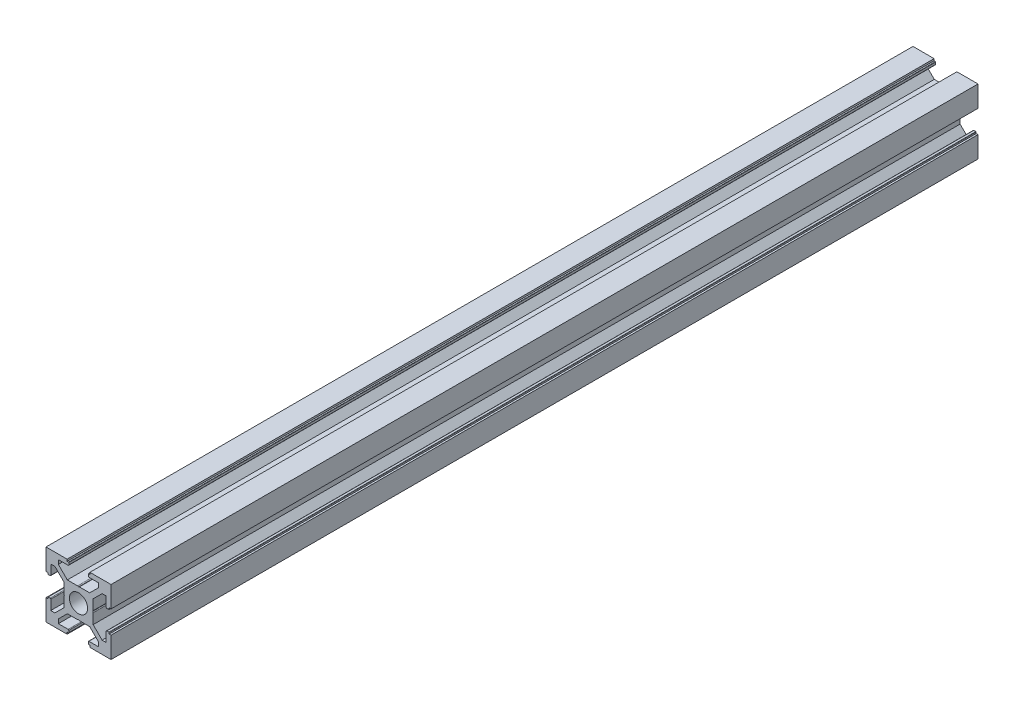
ISO-10303-21;
HEADER;
FILE_DESCRIPTION(('STEP AP214'),'2;1');
FILE_NAME('part.step','',(''),(''),'','','');
FILE_SCHEMA(('AUTOMOTIVE_DESIGN { 1 0 10303 214 1 1 1 1 }'));
ENDSEC;
DATA;
#1=APPLICATION_CONTEXT('core data for automotive mechanical design processes');
#2=APPLICATION_PROTOCOL_DEFINITION('international standard','automotive_design',2000,#1);
#3=PRODUCT_CONTEXT('',#1,'mechanical');
#4=PRODUCT('Part','Part','',(#3));
#5=PRODUCT_RELATED_PRODUCT_CATEGORY('part','',(#4));
#6=PRODUCT_DEFINITION_FORMATION('','',#4);
#7=PRODUCT_DEFINITION_CONTEXT('part definition',#1,'design');
#8=PRODUCT_DEFINITION('design','',#6,#7);
#9=PRODUCT_DEFINITION_SHAPE('','',#8);
#10=(LENGTH_UNIT() NAMED_UNIT(*) SI_UNIT(.MILLI.,.METRE.));
#11=(NAMED_UNIT(*) PLANE_ANGLE_UNIT() SI_UNIT($,.RADIAN.));
#12=(NAMED_UNIT(*) SI_UNIT($,.STERADIAN.) SOLID_ANGLE_UNIT());
#13=UNCERTAINTY_MEASURE_WITH_UNIT(LENGTH_MEASURE(1.E-05),#10,'distance_accuracy_value','');
#14=(GEOMETRIC_REPRESENTATION_CONTEXT(3) GLOBAL_UNCERTAINTY_ASSIGNED_CONTEXT((#13)) GLOBAL_UNIT_ASSIGNED_CONTEXT((#10,
#11,#12)) REPRESENTATION_CONTEXT('',''));
#15=CARTESIAN_POINT('',(0.,0.,0.));
#16=DIRECTION('',(0.,0.,1.));
#17=DIRECTION('',(1.,0.,0.));
#18=AXIS2_PLACEMENT_3D('',#15,#16,#17);
#19=CARTESIAN_POINT('',(0.45,-6.3,400.));
#20=DIRECTION('',(0.,0.,-1.));
#21=DIRECTION('',(-1.,0.,0.));
#22=AXIS2_PLACEMENT_3D('',#19,#20,#21);
#23=CYLINDRICAL_SURFACE('',#22,0.45);
#24=CARTESIAN_POINT('',(0.45,-6.3,0.));
#25=DIRECTION('',(0.,0.,1.));
#26=DIRECTION('',(1.,0.,0.));
#27=AXIS2_PLACEMENT_3D('',#24,#25,#26);
#28=CIRCLE('',#27,0.45);
#29=CARTESIAN_POINT('',(0.450000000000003,-6.75,0.));
#30=VERTEX_POINT('',#29);
#31=CARTESIAN_POINT('',(0.,-6.3,0.));
#32=VERTEX_POINT('',#31);
#33=EDGE_CURVE('E579',#30,#32,#28,.F.);
#34=ORIENTED_EDGE('',*,*,#33,.F.);
#35=DIRECTION('',(0.,0.,-1.));
#36=VECTOR('',#35,1.);
#37=CARTESIAN_POINT('',(0.450000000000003,-6.75,400.));
#38=LINE('',#37,#36);
#39=CARTESIAN_POINT('',(0.450000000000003,-6.75,400.));
#40=VERTEX_POINT('',#39);
#41=EDGE_CURVE('E11',#40,#30,#38,.T.);
#42=ORIENTED_EDGE('',*,*,#41,.F.);
#43=CARTESIAN_POINT('',(0.45,-6.3,400.));
#44=DIRECTION('',(0.,0.,1.));
#45=DIRECTION('',(1.,0.,0.));
#46=AXIS2_PLACEMENT_3D('',#43,#44,#45);
#47=CIRCLE('',#46,0.45);
#48=CARTESIAN_POINT('',(0.,-6.3,400.));
#49=VERTEX_POINT('',#48);
#50=EDGE_CURVE('E821',#40,#49,#47,.F.);
#51=ORIENTED_EDGE('',*,*,#50,.T.);
#52=DIRECTION('',(0.,0.,-1.));
#53=VECTOR('',#52,1.);
#54=CARTESIAN_POINT('',(0.,-6.3,400.));
#55=LINE('',#54,#53);
#56=EDGE_CURVE('E580',#49,#32,#55,.T.);
#57=ORIENTED_EDGE('',*,*,#56,.T.);
#58=EDGE_LOOP('',(#34,#42,#51,#57));
#59=FACE_BOUND('',#58,.T.);
#60=ADVANCED_FACE('F26',(#59),#23,.T.);
#61=CARTESIAN_POINT('',(0.,-6.75,400.));
#62=DIRECTION('',(0.,-1.,0.));
#63=DIRECTION('',(0.,0.,-1.));
#64=AXIS2_PLACEMENT_3D('',#61,#62,#63);
#65=PLANE('',#64);
#66=DIRECTION('',(-1.,0.,0.));
#67=VECTOR('',#66,1.);
#68=CARTESIAN_POINT('',(0.,-6.75,0.));
#69=LINE('',#68,#67);
#70=CARTESIAN_POINT('',(5.15900974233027,-6.75,0.));
#71=VERTEX_POINT('',#70);
#72=EDGE_CURVE('E572',#71,#30,#69,.T.);
#73=ORIENTED_EDGE('',*,*,#72,.F.);
#74=DIRECTION('',(0.,0.,-1.));
#75=VECTOR('',#74,1.);
#76=CARTESIAN_POINT('',(5.15900974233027,-6.75,400.));
#77=LINE('',#76,#75);
#78=CARTESIAN_POINT('',(5.15900974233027,-6.75,400.));
#79=VERTEX_POINT('',#78);
#80=EDGE_CURVE('E33',#79,#71,#77,.T.);
#81=ORIENTED_EDGE('',*,*,#80,.F.);
#82=DIRECTION('',(-1.,0.,0.));
#83=VECTOR('',#82,1.);
#84=CARTESIAN_POINT('',(0.,-6.75,400.));
#85=LINE('',#84,#83);
#86=EDGE_CURVE('E575',#79,#40,#85,.T.);
#87=ORIENTED_EDGE('',*,*,#86,.T.);
#88=ORIENTED_EDGE('',*,*,#41,.T.);
#89=EDGE_LOOP('',(#73,#81,#87,#88));
#90=FACE_BOUND('',#89,.T.);
#91=ADVANCED_FACE('F570',(#90),#65,.T.);
#92=CARTESIAN_POINT('',(15.7752155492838,-17.3662058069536,400.));
#93=DIRECTION('',(-0.707106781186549,-0.707106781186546,0.));
#94=DIRECTION('',(0.707106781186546,-0.707106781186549,0.));
#95=AXIS2_PLACEMENT_3D('',#92,#93,#94);
#96=PLANE('',#95);
#97=DIRECTION('',(-0.707106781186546,0.707106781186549,0.));
#98=VECTOR('',#97,1.);
#99=CARTESIAN_POINT('',(15.7752155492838,-17.3662058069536,0.));
#100=LINE('',#99,#98);
#101=CARTESIAN_POINT('',(9.3,-10.8909902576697,0.));
#102=VERTEX_POINT('',#101);
#103=EDGE_CURVE('E589',#102,#71,#100,.T.);
#104=ORIENTED_EDGE('',*,*,#103,.F.);
#105=DIRECTION('',(0.,0.,-1.));
#106=VECTOR('',#105,1.);
#107=CARTESIAN_POINT('',(9.3,-10.8909902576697,400.));
#108=LINE('',#107,#106);
#109=CARTESIAN_POINT('',(9.3,-10.8909902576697,400.));
#110=VERTEX_POINT('',#109);
#111=EDGE_CURVE('E1236',#110,#102,#108,.T.);
#112=ORIENTED_EDGE('',*,*,#111,.F.);
#113=DIRECTION('',(-0.707106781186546,0.707106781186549,0.));
#114=VECTOR('',#113,1.);
#115=CARTESIAN_POINT('',(15.7752155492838,-17.3662058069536,400.));
#116=LINE('',#115,#114);
#117=EDGE_CURVE('E824',#110,#79,#116,.T.);
#118=ORIENTED_EDGE('',*,*,#117,.T.);
#119=ORIENTED_EDGE('',*,*,#80,.T.);
#120=EDGE_LOOP('',(#104,#112,#118,#119));
#121=FACE_BOUND('',#120,.T.);
#122=ADVANCED_FACE('F1238',(#121),#96,.T.);
#123=CARTESIAN_POINT('',(9.3,-33.1414213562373,400.));
#124=DIRECTION('',(-1.,0.,0.));
#125=DIRECTION('',(0.,0.,1.));
#126=AXIS2_PLACEMENT_3D('',#123,#124,#125);
#127=PLANE('',#126);
#128=DIRECTION('',(0.,1.,0.));
#129=VECTOR('',#128,1.);
#130=CARTESIAN_POINT('',(9.3,-33.1414213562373,0.));
#131=LINE('',#130,#129);
#132=CARTESIAN_POINT('',(9.3,-12.795,0.));
#133=VERTEX_POINT('',#132);
#134=EDGE_CURVE('E591',#133,#102,#131,.T.);
#135=ORIENTED_EDGE('',*,*,#134,.F.);
#136=DIRECTION('',(0.,0.,-1.));
#137=VECTOR('',#136,1.);
#138=CARTESIAN_POINT('',(9.3,-12.795,400.));
#139=LINE('',#138,#137);
#140=CARTESIAN_POINT('',(9.3,-12.795,400.));
#141=VERTEX_POINT('',#140);
#142=EDGE_CURVE('E1234',#141,#133,#139,.T.);
#143=ORIENTED_EDGE('',*,*,#142,.F.);
#144=DIRECTION('',(0.,1.,0.));
#145=VECTOR('',#144,1.);
#146=CARTESIAN_POINT('',(9.3,-33.1414213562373,400.));
#147=LINE('',#146,#145);
#148=EDGE_CURVE('E827',#141,#110,#147,.T.);
#149=ORIENTED_EDGE('',*,*,#148,.T.);
#150=ORIENTED_EDGE('',*,*,#111,.T.);
#151=EDGE_LOOP('',(#135,#143,#149,#150));
#152=FACE_BOUND('',#151,.T.);
#153=ADVANCED_FACE('F1245',(#152),#127,.T.);
#154=CARTESIAN_POINT('',(0.,-12.795,400.));
#155=DIRECTION('',(0.,-1.,0.));
#156=DIRECTION('',(0.,0.,-1.));
#157=AXIS2_PLACEMENT_3D('',#154,#155,#156);
#158=PLANE('',#157);
#159=DIRECTION('',(-1.,0.,0.));
#160=VECTOR('',#159,1.);
#161=CARTESIAN_POINT('',(0.,-12.795,0.));
#162=LINE('',#161,#160);
#163=CARTESIAN_POINT('',(4.80000000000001,-12.795,0.));
#164=VERTEX_POINT('',#163);
#165=EDGE_CURVE('E595',#133,#164,#162,.T.);
#166=ORIENTED_EDGE('',*,*,#165,.T.);
#167=DIRECTION('',(0.,0.,-1.));
#168=VECTOR('',#167,1.);
#169=CARTESIAN_POINT('',(4.80000000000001,-12.795,400.));
#170=LINE('',#169,#168);
#171=CARTESIAN_POINT('',(4.80000000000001,-12.795,400.));
#172=VERTEX_POINT('',#171);
#173=EDGE_CURVE('E1231',#172,#164,#170,.T.);
#174=ORIENTED_EDGE('',*,*,#173,.F.);
#175=DIRECTION('',(-1.,0.,0.));
#176=VECTOR('',#175,1.);
#177=CARTESIAN_POINT('',(0.,-12.795,400.));
#178=LINE('',#177,#176);
#179=EDGE_CURVE('E830',#141,#172,#178,.T.);
#180=ORIENTED_EDGE('',*,*,#179,.F.);
#181=ORIENTED_EDGE('',*,*,#142,.T.);
#182=EDGE_LOOP('',(#166,#174,#180,#181));
#183=FACE_BOUND('',#182,.T.);
#184=ADVANCED_FACE('F1250',(#183),#158,.F.);
#185=CARTESIAN_POINT('',(4.8,-13.095,400.));
#186=DIRECTION('',(0.,0.,-1.));
#187=DIRECTION('',(-1.,0.,0.));
#188=AXIS2_PLACEMENT_3D('',#185,#186,#187);
#189=CYLINDRICAL_SURFACE('',#188,0.300000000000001);
#190=CARTESIAN_POINT('',(4.8,-13.095,0.));
#191=DIRECTION('',(0.,0.,1.));
#192=DIRECTION('',(1.,0.,0.));
#193=AXIS2_PLACEMENT_3D('',#190,#191,#192);
#194=CIRCLE('',#193,0.300000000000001);
#195=CARTESIAN_POINT('',(4.5,-13.095,0.));
#196=VERTEX_POINT('',#195);
#197=EDGE_CURVE('E597',#164,#196,#194,.T.);
#198=ORIENTED_EDGE('',*,*,#197,.T.);
#199=DIRECTION('',(0.,0.,-1.));
#200=VECTOR('',#199,1.);
#201=CARTESIAN_POINT('',(4.5,-13.095,400.));
#202=LINE('',#201,#200);
#203=CARTESIAN_POINT('',(4.5,-13.095,400.));
#204=VERTEX_POINT('',#203);
#205=EDGE_CURVE('E1228',#204,#196,#202,.T.);
#206=ORIENTED_EDGE('',*,*,#205,.F.);
#207=CARTESIAN_POINT('',(4.8,-13.095,400.));
#208=DIRECTION('',(0.,0.,1.));
#209=DIRECTION('',(1.,0.,0.));
#210=AXIS2_PLACEMENT_3D('',#207,#208,#209);
#211=CIRCLE('',#210,0.300000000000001);
#212=EDGE_CURVE('E832',#172,#204,#211,.T.);
#213=ORIENTED_EDGE('',*,*,#212,.F.);
#214=ORIENTED_EDGE('',*,*,#173,.T.);
#215=EDGE_LOOP('',(#198,#206,#213,#214));
#216=FACE_BOUND('',#215,.T.);
#217=ADVANCED_FACE('F1256',(#216),#189,.T.);
#218=CARTESIAN_POINT('',(4.5,-33.1414213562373,400.));
#219=DIRECTION('',(1.,0.,0.));
#220=DIRECTION('',(0.,0.,-1.));
#221=AXIS2_PLACEMENT_3D('',#218,#219,#220);
#222=PLANE('',#221);
#223=DIRECTION('',(0.,-1.,0.));
#224=VECTOR('',#223,1.);
#225=CARTESIAN_POINT('',(4.5,-33.1414213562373,0.));
#226=LINE('',#225,#224);
#227=CARTESIAN_POINT('',(4.5,-13.995,0.));
#228=VERTEX_POINT('',#227);
#229=EDGE_CURVE('E599',#196,#228,#226,.T.);
#230=ORIENTED_EDGE('',*,*,#229,.T.);
#231=DIRECTION('',(0.,0.,-1.));
#232=VECTOR('',#231,1.);
#233=CARTESIAN_POINT('',(4.5,-13.995,400.));
#234=LINE('',#233,#232);
#235=CARTESIAN_POINT('',(4.5,-13.995,400.));
#236=VERTEX_POINT('',#235);
#237=EDGE_CURVE('E1225',#236,#228,#234,.T.);
#238=ORIENTED_EDGE('',*,*,#237,.F.);
#239=DIRECTION('',(0.,-1.,0.));
#240=VECTOR('',#239,1.);
#241=CARTESIAN_POINT('',(4.5,-33.1414213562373,400.));
#242=LINE('',#241,#240);
#243=EDGE_CURVE('E834',#204,#236,#242,.T.);
#244=ORIENTED_EDGE('',*,*,#243,.F.);
#245=ORIENTED_EDGE('',*,*,#205,.T.);
#246=EDGE_LOOP('',(#230,#238,#244,#245));
#247=FACE_BOUND('',#246,.T.);
#248=ADVANCED_FACE('F1260',(#247),#222,.F.);
#249=CARTESIAN_POINT('',(4.65,-13.995,400.));
#250=DIRECTION('',(0.,0.,-1.));
#251=DIRECTION('',(-1.,0.,0.));
#252=AXIS2_PLACEMENT_3D('',#249,#250,#251);
#253=CYLINDRICAL_SURFACE('',#252,0.15);
#254=CARTESIAN_POINT('',(4.65,-13.995,0.));
#255=DIRECTION('',(0.,0.,1.));
#256=DIRECTION('',(1.,0.,0.));
#257=AXIS2_PLACEMENT_3D('',#254,#255,#256);
#258=CIRCLE('',#257,0.15);
#259=CARTESIAN_POINT('',(4.65,-14.145,0.));
#260=VERTEX_POINT('',#259);
#261=EDGE_CURVE('E601',#228,#260,#258,.T.);
#262=ORIENTED_EDGE('',*,*,#261,.T.);
#263=DIRECTION('',(0.,0.,-1.));
#264=VECTOR('',#263,1.);
#265=CARTESIAN_POINT('',(4.65,-14.145,400.));
#266=LINE('',#265,#264);
#267=CARTESIAN_POINT('',(4.65,-14.145,400.));
#268=VERTEX_POINT('',#267);
#269=EDGE_CURVE('E1222',#268,#260,#266,.T.);
#270=ORIENTED_EDGE('',*,*,#269,.F.);
#271=CARTESIAN_POINT('',(4.65,-13.995,400.));
#272=DIRECTION('',(0.,0.,1.));
#273=DIRECTION('',(1.,0.,0.));
#274=AXIS2_PLACEMENT_3D('',#271,#272,#273);
#275=CIRCLE('',#274,0.15);
#276=EDGE_CURVE('E836',#236,#268,#275,.T.);
#277=ORIENTED_EDGE('',*,*,#276,.F.);
#278=ORIENTED_EDGE('',*,*,#237,.T.);
#279=EDGE_LOOP('',(#262,#270,#277,#278));
#280=FACE_BOUND('',#279,.T.);
#281=ADVANCED_FACE('F1265',(#280),#253,.T.);
#282=CARTESIAN_POINT('',(0.,-14.145,400.));
#283=DIRECTION('',(0.,1.,0.));
#284=DIRECTION('',(0.,0.,1.));
#285=AXIS2_PLACEMENT_3D('',#282,#283,#284);
#286=PLANE('',#285);
#287=DIRECTION('',(1.,0.,0.));
#288=VECTOR('',#287,1.);
#289=CARTESIAN_POINT('',(0.,-14.145,0.));
#290=LINE('',#289,#288);
#291=CARTESIAN_POINT('',(5.25,-14.145,0.));
#292=VERTEX_POINT('',#291);
#293=EDGE_CURVE('E603',#260,#292,#290,.T.);
#294=ORIENTED_EDGE('',*,*,#293,.T.);
#295=DIRECTION('',(0.,0.,-1.));
#296=VECTOR('',#295,1.);
#297=CARTESIAN_POINT('',(5.25,-14.145,400.));
#298=LINE('',#297,#296);
#299=CARTESIAN_POINT('',(5.25,-14.145,400.));
#300=VERTEX_POINT('',#299);
#301=EDGE_CURVE('E1219',#300,#292,#298,.T.);
#302=ORIENTED_EDGE('',*,*,#301,.F.);
#303=DIRECTION('',(1.,0.,0.));
#304=VECTOR('',#303,1.);
#305=CARTESIAN_POINT('',(0.,-14.145,400.));
#306=LINE('',#305,#304);
#307=EDGE_CURVE('E838',#268,#300,#306,.T.);
#308=ORIENTED_EDGE('',*,*,#307,.F.);
#309=ORIENTED_EDGE('',*,*,#269,.T.);
#310=EDGE_LOOP('',(#294,#302,#308,#309));
#311=FACE_BOUND('',#310,.T.);
#312=ADVANCED_FACE('F1272',(#311),#286,.F.);
#313=CARTESIAN_POINT('',(5.25,-33.1414213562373,400.));
#314=DIRECTION('',(1.,0.,0.));
#315=DIRECTION('',(0.,0.,-1.));
#316=AXIS2_PLACEMENT_3D('',#313,#314,#315);
#317=PLANE('',#316);
#318=DIRECTION('',(0.,-1.,0.));
#319=VECTOR('',#318,1.);
#320=CARTESIAN_POINT('',(5.25,-33.1414213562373,0.));
#321=LINE('',#320,#319);
#322=CARTESIAN_POINT('',(5.25,-15.,0.));
#323=VERTEX_POINT('',#322);
#324=EDGE_CURVE('E605',#292,#323,#321,.T.);
#325=ORIENTED_EDGE('',*,*,#324,.T.);
#326=DIRECTION('',(0.,0.,-1.));
#327=VECTOR('',#326,1.);
#328=CARTESIAN_POINT('',(5.25,-15.,400.));
#329=LINE('',#328,#327);
#330=CARTESIAN_POINT('',(5.25,-15.,400.));
#331=VERTEX_POINT('',#330);
#332=EDGE_CURVE('E1217',#331,#323,#329,.T.);
#333=ORIENTED_EDGE('',*,*,#332,.F.);
#334=DIRECTION('',(0.,-1.,0.));
#335=VECTOR('',#334,1.);
#336=CARTESIAN_POINT('',(5.25,-33.1414213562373,400.));
#337=LINE('',#336,#335);
#338=EDGE_CURVE('E840',#300,#331,#337,.T.);
#339=ORIENTED_EDGE('',*,*,#338,.F.);
#340=ORIENTED_EDGE('',*,*,#301,.T.);
#341=EDGE_LOOP('',(#325,#333,#339,#340));
#342=FACE_BOUND('',#341,.T.);
#343=ADVANCED_FACE('F1276',(#342),#317,.F.);
#344=CARTESIAN_POINT('',(0.,-15.,400.));
#345=DIRECTION('',(0.,-1.,0.));
#346=DIRECTION('',(0.,0.,-1.));
#347=AXIS2_PLACEMENT_3D('',#344,#345,#346);
#348=PLANE('',#347);
#349=DIRECTION('',(-1.,0.,0.));
#350=VECTOR('',#349,1.);
#351=CARTESIAN_POINT('',(0.,-15.,0.));
#352=LINE('',#351,#350);
#353=CARTESIAN_POINT('',(15.,-15.,0.));
#354=VERTEX_POINT('',#353);
#355=EDGE_CURVE('E608',#354,#323,#352,.T.);
#356=ORIENTED_EDGE('',*,*,#355,.F.);
#357=DIRECTION('',(0.,0.,-1.));
#358=VECTOR('',#357,1.);
#359=CARTESIAN_POINT('',(15.,-15.,400.));
#360=LINE('',#359,#358);
#361=CARTESIAN_POINT('',(15.,-15.,400.));
#362=VERTEX_POINT('',#361);
#363=EDGE_CURVE('E1215',#362,#354,#360,.T.);
#364=ORIENTED_EDGE('',*,*,#363,.F.);
#365=DIRECTION('',(-1.,0.,0.));
#366=VECTOR('',#365,1.);
#367=CARTESIAN_POINT('',(0.,-15.,400.));
#368=LINE('',#367,#366);
#369=EDGE_CURVE('E842',#362,#331,#368,.T.);
#370=ORIENTED_EDGE('',*,*,#369,.T.);
#371=ORIENTED_EDGE('',*,*,#332,.T.);
#372=EDGE_LOOP('',(#356,#364,#370,#371));
#373=FACE_BOUND('',#372,.T.);
#374=ADVANCED_FACE('F1279',(#373),#348,.T.);
#375=CARTESIAN_POINT('',(15.,-33.1414213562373,400.));
#376=DIRECTION('',(-1.,0.,0.));
#377=DIRECTION('',(0.,-1.,0.));
#378=AXIS2_PLACEMENT_3D('',#375,#376,#377);
#379=PLANE('',#378);
#380=DIRECTION('',(0.,1.,0.));
#381=VECTOR('',#380,1.);
#382=CARTESIAN_POINT('',(15.,-33.1414213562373,0.));
#383=LINE('',#382,#381);
#384=CARTESIAN_POINT('',(15.,-5.25000000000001,0.));
#385=VERTEX_POINT('',#384);
#386=EDGE_CURVE('E611',#354,#385,#383,.T.);
#387=ORIENTED_EDGE('',*,*,#386,.T.);
#388=DIRECTION('',(0.,0.,-1.));
#389=VECTOR('',#388,1.);
#390=CARTESIAN_POINT('',(15.,-5.25000000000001,400.));
#391=LINE('',#390,#389);
#392=CARTESIAN_POINT('',(15.,-5.25000000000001,400.));
#393=VERTEX_POINT('',#392);
#394=EDGE_CURVE('E1213',#393,#385,#391,.T.);
#395=ORIENTED_EDGE('',*,*,#394,.F.);
#396=DIRECTION('',(0.,1.,0.));
#397=VECTOR('',#396,1.);
#398=CARTESIAN_POINT('',(15.,-33.1414213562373,400.));
#399=LINE('',#398,#397);
#400=EDGE_CURVE('E845',#362,#393,#399,.T.);
#401=ORIENTED_EDGE('',*,*,#400,.F.);
#402=ORIENTED_EDGE('',*,*,#363,.T.);
#403=EDGE_LOOP('',(#387,#395,#401,#402));
#404=FACE_BOUND('',#403,.T.);
#405=ADVANCED_FACE('F1285',(#404),#379,.F.);
#406=CARTESIAN_POINT('',(0.,-5.24999999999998,400.));
#407=DIRECTION('',(0.,1.,0.));
#408=DIRECTION('',(-1.,0.,0.));
#409=AXIS2_PLACEMENT_3D('',#406,#407,#408);
#410=PLANE('',#409);
#411=DIRECTION('',(1.,0.,0.));
#412=VECTOR('',#411,1.);
#413=CARTESIAN_POINT('',(0.,-5.24999999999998,0.));
#414=LINE('',#413,#412);
#415=CARTESIAN_POINT('',(14.145,-5.25,0.));
#416=VERTEX_POINT('',#415);
#417=EDGE_CURVE('E614',#416,#385,#414,.T.);
#418=ORIENTED_EDGE('',*,*,#417,.F.);
#419=DIRECTION('',(0.,0.,-1.));
#420=VECTOR('',#419,1.);
#421=CARTESIAN_POINT('',(14.145,-5.25,400.));
#422=LINE('',#421,#420);
#423=CARTESIAN_POINT('',(14.145,-5.25,400.));
#424=VERTEX_POINT('',#423);
#425=EDGE_CURVE('E1211',#424,#416,#422,.T.);
#426=ORIENTED_EDGE('',*,*,#425,.F.);
#427=DIRECTION('',(1.,0.,0.));
#428=VECTOR('',#427,1.);
#429=CARTESIAN_POINT('',(0.,-5.24999999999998,400.));
#430=LINE('',#429,#428);
#431=EDGE_CURVE('E847',#424,#393,#430,.T.);
#432=ORIENTED_EDGE('',*,*,#431,.T.);
#433=ORIENTED_EDGE('',*,*,#394,.T.);
#434=EDGE_LOOP('',(#418,#426,#432,#433));
#435=FACE_BOUND('',#434,.T.);
#436=ADVANCED_FACE('F1289',(#435),#410,.T.);
#437=CARTESIAN_POINT('',(14.145,-33.1414213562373,400.));
#438=DIRECTION('',(1.,0.,0.));
#439=DIRECTION('',(0.,0.,-1.));
#440=AXIS2_PLACEMENT_3D('',#437,#438,#439);
#441=PLANE('',#440);
#442=DIRECTION('',(0.,-1.,0.));
#443=VECTOR('',#442,1.);
#444=CARTESIAN_POINT('',(14.145,-33.1414213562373,0.));
#445=LINE('',#444,#443);
#446=CARTESIAN_POINT('',(14.145,-4.65000000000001,0.));
#447=VERTEX_POINT('',#446);
#448=EDGE_CURVE('E617',#447,#416,#445,.T.);
#449=ORIENTED_EDGE('',*,*,#448,.F.);
#450=DIRECTION('',(0.,0.,-1.));
#451=VECTOR('',#450,1.);
#452=CARTESIAN_POINT('',(14.145,-4.65000000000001,400.));
#453=LINE('',#452,#451);
#454=CARTESIAN_POINT('',(14.145,-4.65000000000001,400.));
#455=VERTEX_POINT('',#454);
#456=EDGE_CURVE('E1209',#455,#447,#453,.T.);
#457=ORIENTED_EDGE('',*,*,#456,.F.);
#458=DIRECTION('',(0.,-1.,0.));
#459=VECTOR('',#458,1.);
#460=CARTESIAN_POINT('',(14.145,-33.1414213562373,400.));
#461=LINE('',#460,#459);
#462=EDGE_CURVE('E850',#455,#424,#461,.T.);
#463=ORIENTED_EDGE('',*,*,#462,.T.);
#464=ORIENTED_EDGE('',*,*,#425,.T.);
#465=EDGE_LOOP('',(#449,#457,#463,#464));
#466=FACE_BOUND('',#465,.T.);
#467=ADVANCED_FACE('F1292',(#466),#441,.T.);
#468=CARTESIAN_POINT('',(13.995,-4.65,400.));
#469=DIRECTION('',(0.,0.,-1.));
#470=DIRECTION('',(-1.,0.,0.));
#471=AXIS2_PLACEMENT_3D('',#468,#469,#470);
#472=CYLINDRICAL_SURFACE('',#471,0.15);
#473=CARTESIAN_POINT('',(13.995,-4.65,0.));
#474=DIRECTION('',(0.,0.,1.));
#475=DIRECTION('',(1.,0.,0.));
#476=AXIS2_PLACEMENT_3D('',#473,#474,#475);
#477=CIRCLE('',#476,0.15);
#478=CARTESIAN_POINT('',(13.995,-4.5,0.));
#479=VERTEX_POINT('',#478);
#480=EDGE_CURVE('E620',#479,#447,#477,.F.);
#481=ORIENTED_EDGE('',*,*,#480,.F.);
#482=DIRECTION('',(0.,0.,-1.));
#483=VECTOR('',#482,1.);
#484=CARTESIAN_POINT('',(13.995,-4.5,400.));
#485=LINE('',#484,#483);
#486=CARTESIAN_POINT('',(13.995,-4.5,400.));
#487=VERTEX_POINT('',#486);
#488=EDGE_CURVE('E1207',#487,#479,#485,.T.);
#489=ORIENTED_EDGE('',*,*,#488,.F.);
#490=CARTESIAN_POINT('',(13.995,-4.65,400.));
#491=DIRECTION('',(0.,0.,1.));
#492=DIRECTION('',(1.,0.,0.));
#493=AXIS2_PLACEMENT_3D('',#490,#491,#492);
#494=CIRCLE('',#493,0.15);
#495=EDGE_CURVE('E853',#487,#455,#494,.F.);
#496=ORIENTED_EDGE('',*,*,#495,.T.);
#497=ORIENTED_EDGE('',*,*,#456,.T.);
#498=EDGE_LOOP('',(#481,#489,#496,#497));
#499=FACE_BOUND('',#498,.T.);
#500=ADVANCED_FACE('F1297',(#499),#472,.T.);
#501=CARTESIAN_POINT('',(0.,-4.5,400.));
#502=DIRECTION('',(0.,1.,0.));
#503=DIRECTION('',(0.,0.,1.));
#504=AXIS2_PLACEMENT_3D('',#501,#502,#503);
#505=PLANE('',#504);
#506=DIRECTION('',(1.,0.,0.));
#507=VECTOR('',#506,1.);
#508=CARTESIAN_POINT('',(0.,-4.5,0.));
#509=LINE('',#508,#507);
#510=CARTESIAN_POINT('',(13.095,-4.5,0.));
#511=VERTEX_POINT('',#510);
#512=EDGE_CURVE('E623',#511,#479,#509,.T.);
#513=ORIENTED_EDGE('',*,*,#512,.F.);
#514=DIRECTION('',(0.,0.,-1.));
#515=VECTOR('',#514,1.);
#516=CARTESIAN_POINT('',(13.095,-4.5,400.));
#517=LINE('',#516,#515);
#518=CARTESIAN_POINT('',(13.095,-4.5,400.));
#519=VERTEX_POINT('',#518);
#520=EDGE_CURVE('E1205',#519,#511,#517,.T.);
#521=ORIENTED_EDGE('',*,*,#520,.F.);
#522=DIRECTION('',(1.,0.,0.));
#523=VECTOR('',#522,1.);
#524=CARTESIAN_POINT('',(0.,-4.5,400.));
#525=LINE('',#524,#523);
#526=EDGE_CURVE('E856',#519,#487,#525,.T.);
#527=ORIENTED_EDGE('',*,*,#526,.T.);
#528=ORIENTED_EDGE('',*,*,#488,.T.);
#529=EDGE_LOOP('',(#513,#521,#527,#528));
#530=FACE_BOUND('',#529,.T.);
#531=ADVANCED_FACE('F1300',(#530),#505,.T.);
#532=CARTESIAN_POINT('',(13.095,-4.80000000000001,400.));
#533=DIRECTION('',(0.,0.,-1.));
#534=DIRECTION('',(-1.,0.,0.));
#535=AXIS2_PLACEMENT_3D('',#532,#533,#534);
#536=CYLINDRICAL_SURFACE('',#535,0.300000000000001);
#537=CARTESIAN_POINT('',(13.095,-4.80000000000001,0.));
#538=DIRECTION('',(0.,0.,1.));
#539=DIRECTION('',(1.,0.,0.));
#540=AXIS2_PLACEMENT_3D('',#537,#538,#539);
#541=CIRCLE('',#540,0.300000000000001);
#542=CARTESIAN_POINT('',(12.795,-4.80000000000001,0.));
#543=VERTEX_POINT('',#542);
#544=EDGE_CURVE('E626',#543,#511,#541,.F.);
#545=ORIENTED_EDGE('',*,*,#544,.F.);
#546=DIRECTION('',(0.,0.,-1.));
#547=VECTOR('',#546,1.);
#548=CARTESIAN_POINT('',(12.795,-4.80000000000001,400.));
#549=LINE('',#548,#547);
#550=CARTESIAN_POINT('',(12.795,-4.80000000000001,400.));
#551=VERTEX_POINT('',#550);
#552=EDGE_CURVE('E1203',#551,#543,#549,.T.);
#553=ORIENTED_EDGE('',*,*,#552,.F.);
#554=CARTESIAN_POINT('',(13.095,-4.80000000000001,400.));
#555=DIRECTION('',(0.,0.,1.));
#556=DIRECTION('',(1.,0.,0.));
#557=AXIS2_PLACEMENT_3D('',#554,#555,#556);
#558=CIRCLE('',#557,0.300000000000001);
#559=EDGE_CURVE('E859',#551,#519,#558,.F.);
#560=ORIENTED_EDGE('',*,*,#559,.T.);
#561=ORIENTED_EDGE('',*,*,#520,.T.);
#562=EDGE_LOOP('',(#545,#553,#560,#561));
#563=FACE_BOUND('',#562,.T.);
#564=ADVANCED_FACE('F1305',(#563),#536,.T.);
#565=CARTESIAN_POINT('',(12.795,-33.1414213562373,400.));
#566=DIRECTION('',(-1.,0.,0.));
#567=DIRECTION('',(0.,-1.,0.));
#568=AXIS2_PLACEMENT_3D('',#565,#566,#567);
#569=PLANE('',#568);
#570=DIRECTION('',(0.,1.,0.));
#571=VECTOR('',#570,1.);
#572=CARTESIAN_POINT('',(12.795,-33.1414213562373,0.));
#573=LINE('',#572,#571);
#574=CARTESIAN_POINT('',(12.795,-9.3,0.));
#575=VERTEX_POINT('',#574);
#576=EDGE_CURVE('E629',#575,#543,#573,.T.);
#577=ORIENTED_EDGE('',*,*,#576,.F.);
#578=DIRECTION('',(0.,0.,-1.));
#579=VECTOR('',#578,1.);
#580=CARTESIAN_POINT('',(12.795,-9.3,400.));
#581=LINE('',#580,#579);
#582=CARTESIAN_POINT('',(12.795,-9.3,400.));
#583=VERTEX_POINT('',#582);
#584=EDGE_CURVE('E1201',#583,#575,#581,.T.);
#585=ORIENTED_EDGE('',*,*,#584,.F.);
#586=DIRECTION('',(0.,1.,0.));
#587=VECTOR('',#586,1.);
#588=CARTESIAN_POINT('',(12.795,-33.1414213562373,400.));
#589=LINE('',#588,#587);
#590=EDGE_CURVE('E862',#583,#551,#589,.T.);
#591=ORIENTED_EDGE('',*,*,#590,.T.);
#592=ORIENTED_EDGE('',*,*,#552,.T.);
#593=EDGE_LOOP('',(#577,#585,#591,#592));
#594=FACE_BOUND('',#593,.T.);
#595=ADVANCED_FACE('F1308',(#594),#569,.T.);
#596=CARTESIAN_POINT('',(0.,-9.3,400.));
#597=DIRECTION('',(0.,-1.,0.));
#598=DIRECTION('',(0.,0.,-1.));
#599=AXIS2_PLACEMENT_3D('',#596,#597,#598);
#600=PLANE('',#599);
#601=DIRECTION('',(-1.,0.,0.));
#602=VECTOR('',#601,1.);
#603=CARTESIAN_POINT('',(0.,-9.3,0.));
#604=LINE('',#603,#602);
#605=CARTESIAN_POINT('',(10.8909902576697,-9.3,0.));
#606=VERTEX_POINT('',#605);
#607=EDGE_CURVE('E632',#575,#606,#604,.T.);
#608=ORIENTED_EDGE('',*,*,#607,.T.);
#609=DIRECTION('',(0.,0.,-1.));
#610=VECTOR('',#609,1.);
#611=CARTESIAN_POINT('',(10.8909902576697,-9.3,400.));
#612=LINE('',#611,#610);
#613=CARTESIAN_POINT('',(10.8909902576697,-9.3,400.));
#614=VERTEX_POINT('',#613);
#615=EDGE_CURVE('E1198',#614,#606,#612,.T.);
#616=ORIENTED_EDGE('',*,*,#615,.F.);
#617=DIRECTION('',(-1.,0.,0.));
#618=VECTOR('',#617,1.);
#619=CARTESIAN_POINT('',(0.,-9.3,400.));
#620=LINE('',#619,#618);
#621=EDGE_CURVE('E865',#583,#614,#620,.T.);
#622=ORIENTED_EDGE('',*,*,#621,.F.);
#623=ORIENTED_EDGE('',*,*,#584,.T.);
#624=EDGE_LOOP('',(#608,#616,#622,#623));
#625=FACE_BOUND('',#624,.T.);
#626=ADVANCED_FACE('F1315',(#625),#600,.F.);
#627=CARTESIAN_POINT('',(17.3662058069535,-15.7752155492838,400.));
#628=DIRECTION('',(-0.707106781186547,-0.707106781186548,0.));
#629=DIRECTION('',(0.707106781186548,-0.707106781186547,0.));
#630=AXIS2_PLACEMENT_3D('',#627,#628,#629);
#631=PLANE('',#630);
#632=DIRECTION('',(-0.707106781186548,0.707106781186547,0.));
#633=VECTOR('',#632,1.);
#634=CARTESIAN_POINT('',(17.3662058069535,-15.7752155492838,0.));
#635=LINE('',#634,#633);
#636=CARTESIAN_POINT('',(6.75,-5.15900974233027,0.));
#637=VERTEX_POINT('',#636);
#638=EDGE_CURVE('E634',#606,#637,#635,.T.);
#639=ORIENTED_EDGE('',*,*,#638,.T.);
#640=DIRECTION('',(0.,0.,-1.));
#641=VECTOR('',#640,1.);
#642=CARTESIAN_POINT('',(6.75,-5.15900974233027,400.));
#643=LINE('',#642,#641);
#644=CARTESIAN_POINT('',(6.75,-5.15900974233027,400.));
#645=VERTEX_POINT('',#644);
#646=EDGE_CURVE('E1196',#645,#637,#643,.T.);
#647=ORIENTED_EDGE('',*,*,#646,.F.);
#648=DIRECTION('',(-0.707106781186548,0.707106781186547,0.));
#649=VECTOR('',#648,1.);
#650=CARTESIAN_POINT('',(17.3662058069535,-15.7752155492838,400.));
#651=LINE('',#650,#649);
#652=EDGE_CURVE('E867',#614,#645,#651,.T.);
#653=ORIENTED_EDGE('',*,*,#652,.F.);
#654=ORIENTED_EDGE('',*,*,#615,.T.);
#655=EDGE_LOOP('',(#639,#647,#653,#654));
#656=FACE_BOUND('',#655,.T.);
#657=ADVANCED_FACE('F1319',(#656),#631,.F.);
#658=CARTESIAN_POINT('',(6.75,-33.1414213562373,400.));
#659=DIRECTION('',(1.,0.,0.));
#660=DIRECTION('',(0.,0.,-1.));
#661=AXIS2_PLACEMENT_3D('',#658,#659,#660);
#662=PLANE('',#661);
#663=DIRECTION('',(0.,-1.,0.));
#664=VECTOR('',#663,1.);
#665=CARTESIAN_POINT('',(6.75,-33.1414213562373,0.));
#666=LINE('',#665,#664);
#667=CARTESIAN_POINT('',(6.75,-0.450000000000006,0.));
#668=VERTEX_POINT('',#667);
#669=EDGE_CURVE('E637',#668,#637,#666,.T.);
#670=ORIENTED_EDGE('',*,*,#669,.F.);
#671=DIRECTION('',(0.,0.,-1.));
#672=VECTOR('',#671,1.);
#673=CARTESIAN_POINT('',(6.75,-0.450000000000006,400.));
#674=LINE('',#673,#672);
#675=CARTESIAN_POINT('',(6.75,-0.450000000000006,400.));
#676=VERTEX_POINT('',#675);
#677=EDGE_CURVE('E1194',#676,#668,#674,.T.);
#678=ORIENTED_EDGE('',*,*,#677,.F.);
#679=DIRECTION('',(0.,-1.,0.));
#680=VECTOR('',#679,1.);
#681=CARTESIAN_POINT('',(6.75,-33.1414213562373,400.));
#682=LINE('',#681,#680);
#683=EDGE_CURVE('E869',#676,#645,#682,.T.);
#684=ORIENTED_EDGE('',*,*,#683,.T.);
#685=ORIENTED_EDGE('',*,*,#646,.T.);
#686=EDGE_LOOP('',(#670,#678,#684,#685));
#687=FACE_BOUND('',#686,.T.);
#688=ADVANCED_FACE('F1322',(#687),#662,.T.);
#689=CARTESIAN_POINT('',(6.3,-0.45,400.));
#690=DIRECTION('',(0.,0.,-1.));
#691=DIRECTION('',(-1.,0.,0.));
#692=AXIS2_PLACEMENT_3D('',#689,#690,#691);
#693=CYLINDRICAL_SURFACE('',#692,0.45);
#694=CARTESIAN_POINT('',(6.3,-0.45,0.));
#695=DIRECTION('',(0.,0.,1.));
#696=DIRECTION('',(1.,0.,0.));
#697=AXIS2_PLACEMENT_3D('',#694,#695,#696);
#698=CIRCLE('',#697,0.45);
#699=CARTESIAN_POINT('',(6.3,0.,0.));
#700=VERTEX_POINT('',#699);
#701=EDGE_CURVE('E640',#668,#700,#698,.T.);
#702=ORIENTED_EDGE('',*,*,#701,.T.);
#703=DIRECTION('',(0.,0.,-1.));
#704=VECTOR('',#703,1.);
#705=CARTESIAN_POINT('',(6.3,0.,400.));
#706=LINE('',#705,#704);
#707=CARTESIAN_POINT('',(6.3,0.,400.));
#708=VERTEX_POINT('',#707);
#709=EDGE_CURVE('E1192',#708,#700,#706,.T.);
#710=ORIENTED_EDGE('',*,*,#709,.F.);
#711=CARTESIAN_POINT('',(6.3,-0.45,400.));
#712=DIRECTION('',(0.,0.,1.));
#713=DIRECTION('',(1.,0.,0.));
#714=AXIS2_PLACEMENT_3D('',#711,#712,#713);
#715=CIRCLE('',#714,0.45);
#716=EDGE_CURVE('E872',#676,#708,#715,.T.);
#717=ORIENTED_EDGE('',*,*,#716,.F.);
#718=ORIENTED_EDGE('',*,*,#677,.T.);
#719=EDGE_LOOP('',(#702,#710,#717,#718));
#720=FACE_BOUND('',#719,.T.);
#721=ADVANCED_FACE('F1327',(#720),#693,.T.);
#722=CARTESIAN_POINT('',(6.3,0.45,400.));
#723=DIRECTION('',(0.,0.,-1.));
#724=DIRECTION('',(-1.,0.,0.));
#725=AXIS2_PLACEMENT_3D('',#722,#723,#724);
#726=CYLINDRICAL_SURFACE('',#725,0.45);
#727=CARTESIAN_POINT('',(6.3,0.45,0.));
#728=DIRECTION('',(0.,0.,1.));
#729=DIRECTION('',(1.,0.,0.));
#730=AXIS2_PLACEMENT_3D('',#727,#728,#729);
#731=CIRCLE('',#730,0.45);
#732=CARTESIAN_POINT('',(6.75,0.450000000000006,0.));
#733=VERTEX_POINT('',#732);
#734=EDGE_CURVE('E643',#733,#700,#731,.F.);
#735=ORIENTED_EDGE('',*,*,#734,.F.);
#736=DIRECTION('',(0.,0.,-1.));
#737=VECTOR('',#736,1.);
#738=CARTESIAN_POINT('',(6.75,0.450000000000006,400.));
#739=LINE('',#738,#737);
#740=CARTESIAN_POINT('',(6.75,0.450000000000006,400.));
#741=VERTEX_POINT('',#740);
#742=EDGE_CURVE('E1190',#741,#733,#739,.T.);
#743=ORIENTED_EDGE('',*,*,#742,.F.);
#744=CARTESIAN_POINT('',(6.3,0.45,400.));
#745=DIRECTION('',(0.,0.,1.));
#746=DIRECTION('',(1.,0.,0.));
#747=AXIS2_PLACEMENT_3D('',#744,#745,#746);
#748=CIRCLE('',#747,0.45);
#749=EDGE_CURVE('E874',#741,#708,#748,.F.);
#750=ORIENTED_EDGE('',*,*,#749,.T.);
#751=ORIENTED_EDGE('',*,*,#709,.T.);
#752=EDGE_LOOP('',(#735,#743,#750,#751));
#753=FACE_BOUND('',#752,.T.);
#754=ADVANCED_FACE('F1331',(#753),#726,.T.);
#755=CARTESIAN_POINT('',(6.75,-33.1414213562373,400.));
#756=DIRECTION('',(-1.,0.,0.));
#757=DIRECTION('',(0.,0.,1.));
#758=AXIS2_PLACEMENT_3D('',#755,#756,#757);
#759=PLANE('',#758);
#760=DIRECTION('',(0.,1.,0.));
#761=VECTOR('',#760,1.);
#762=CARTESIAN_POINT('',(6.75,-33.1414213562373,0.));
#763=LINE('',#762,#761);
#764=CARTESIAN_POINT('',(6.75,5.15900974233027,0.));
#765=VERTEX_POINT('',#764);
#766=EDGE_CURVE('E646',#733,#765,#763,.T.);
#767=ORIENTED_EDGE('',*,*,#766,.T.);
#768=DIRECTION('',(0.,0.,-1.));
#769=VECTOR('',#768,1.);
#770=CARTESIAN_POINT('',(6.75,5.15900974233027,400.));
#771=LINE('',#770,#769);
#772=CARTESIAN_POINT('',(6.75,5.15900974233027,400.));
#773=VERTEX_POINT('',#772);
#774=EDGE_CURVE('E1188',#773,#765,#771,.T.);
#775=ORIENTED_EDGE('',*,*,#774,.F.);
#776=DIRECTION('',(0.,1.,0.));
#777=VECTOR('',#776,1.);
#778=CARTESIAN_POINT('',(6.75,-33.1414213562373,400.));
#779=LINE('',#778,#777);
#780=EDGE_CURVE('E877',#741,#773,#779,.T.);
#781=ORIENTED_EDGE('',*,*,#780,.F.);
#782=ORIENTED_EDGE('',*,*,#742,.T.);
#783=EDGE_LOOP('',(#767,#775,#781,#782));
#784=FACE_BOUND('',#783,.T.);
#785=ADVANCED_FACE('F1336',(#784),#759,.F.);
#786=CARTESIAN_POINT('',(-15.7752155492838,-17.3662058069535,400.));
#787=DIRECTION('',(0.707106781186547,-0.707106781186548,0.));
#788=DIRECTION('',(0.707106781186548,0.707106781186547,0.));
#789=AXIS2_PLACEMENT_3D('',#786,#787,#788);
#790=PLANE('',#789);
#791=DIRECTION('',(-0.707106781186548,-0.707106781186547,0.));
#792=VECTOR('',#791,1.);
#793=CARTESIAN_POINT('',(-15.7752155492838,-17.3662058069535,0.));
#794=LINE('',#793,#792);
#795=CARTESIAN_POINT('',(10.8909902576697,9.3,0.));
#796=VERTEX_POINT('',#795);
#797=EDGE_CURVE('E649',#796,#765,#794,.T.);
#798=ORIENTED_EDGE('',*,*,#797,.F.);
#799=DIRECTION('',(0.,0.,-1.));
#800=VECTOR('',#799,1.);
#801=CARTESIAN_POINT('',(10.8909902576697,9.3,400.));
#802=LINE('',#801,#800);
#803=CARTESIAN_POINT('',(10.8909902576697,9.3,400.));
#804=VERTEX_POINT('',#803);
#805=EDGE_CURVE('E1186',#804,#796,#802,.T.);
#806=ORIENTED_EDGE('',*,*,#805,.F.);
#807=DIRECTION('',(-0.707106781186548,-0.707106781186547,0.));
#808=VECTOR('',#807,1.);
#809=CARTESIAN_POINT('',(-15.7752155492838,-17.3662058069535,400.));
#810=LINE('',#809,#808);
#811=EDGE_CURVE('E879',#804,#773,#810,.T.);
#812=ORIENTED_EDGE('',*,*,#811,.T.);
#813=ORIENTED_EDGE('',*,*,#774,.T.);
#814=EDGE_LOOP('',(#798,#806,#812,#813));
#815=FACE_BOUND('',#814,.T.);
#816=ADVANCED_FACE('F1620',(#815),#790,.T.);
#817=CARTESIAN_POINT('',(0.,9.3,400.));
#818=DIRECTION('',(0.,-1.,0.));
#819=DIRECTION('',(0.,0.,-1.));
#820=AXIS2_PLACEMENT_3D('',#817,#818,#819);
#821=PLANE('',#820);
#822=DIRECTION('',(-1.,0.,0.));
#823=VECTOR('',#822,1.);
#824=CARTESIAN_POINT('',(0.,9.3,0.));
#825=LINE('',#824,#823);
#826=CARTESIAN_POINT('',(12.795,9.3,0.));
#827=VERTEX_POINT('',#826);
#828=EDGE_CURVE('E652',#827,#796,#825,.T.);
#829=ORIENTED_EDGE('',*,*,#828,.F.);
#830=DIRECTION('',(0.,0.,-1.));
#831=VECTOR('',#830,1.);
#832=CARTESIAN_POINT('',(12.795,9.3,400.));
#833=LINE('',#832,#831);
#834=CARTESIAN_POINT('',(12.795,9.3,400.));
#835=VERTEX_POINT('',#834);
#836=EDGE_CURVE('E1184',#835,#827,#833,.T.);
#837=ORIENTED_EDGE('',*,*,#836,.F.);
#838=DIRECTION('',(-1.,0.,0.));
#839=VECTOR('',#838,1.);
#840=CARTESIAN_POINT('',(0.,9.3,400.));
#841=LINE('',#840,#839);
#842=EDGE_CURVE('E882',#835,#804,#841,.T.);
#843=ORIENTED_EDGE('',*,*,#842,.T.);
#844=ORIENTED_EDGE('',*,*,#805,.T.);
#845=EDGE_LOOP('',(#829,#837,#843,#844));
#846=FACE_BOUND('',#845,.T.);
#847=ADVANCED_FACE('F1342',(#846),#821,.T.);
#848=CARTESIAN_POINT('',(12.795,-33.1414213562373,400.));
#849=DIRECTION('',(1.,0.,0.));
#850=DIRECTION('',(0.,1.,0.));
#851=AXIS2_PLACEMENT_3D('',#848,#849,#850);
#852=PLANE('',#851);
#853=DIRECTION('',(0.,-1.,0.));
#854=VECTOR('',#853,1.);
#855=CARTESIAN_POINT('',(12.795,-33.1414213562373,0.));
#856=LINE('',#855,#854);
#857=CARTESIAN_POINT('',(12.795,4.80000000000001,0.));
#858=VERTEX_POINT('',#857);
#859=EDGE_CURVE('E655',#827,#858,#856,.T.);
#860=ORIENTED_EDGE('',*,*,#859,.T.);
#861=DIRECTION('',(0.,0.,-1.));
#862=VECTOR('',#861,1.);
#863=CARTESIAN_POINT('',(12.795,4.80000000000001,400.));
#864=LINE('',#863,#862);
#865=CARTESIAN_POINT('',(12.795,4.80000000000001,400.));
#866=VERTEX_POINT('',#865);
#867=EDGE_CURVE('E1181',#866,#858,#864,.T.);
#868=ORIENTED_EDGE('',*,*,#867,.F.);
#869=DIRECTION('',(0.,-1.,0.));
#870=VECTOR('',#869,1.);
#871=CARTESIAN_POINT('',(12.795,-33.1414213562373,400.));
#872=LINE('',#871,#870);
#873=EDGE_CURVE('E885',#835,#866,#872,.T.);
#874=ORIENTED_EDGE('',*,*,#873,.F.);
#875=ORIENTED_EDGE('',*,*,#836,.T.);
#876=EDGE_LOOP('',(#860,#868,#874,#875));
#877=FACE_BOUND('',#876,.T.);
#878=ADVANCED_FACE('F1348',(#877),#852,.F.);
#879=CARTESIAN_POINT('',(13.095,4.80000000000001,400.));
#880=DIRECTION('',(0.,0.,-1.));
#881=DIRECTION('',(-1.,0.,0.));
#882=AXIS2_PLACEMENT_3D('',#879,#880,#881);
#883=CYLINDRICAL_SURFACE('',#882,0.300000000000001);
#884=CARTESIAN_POINT('',(13.095,4.80000000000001,0.));
#885=DIRECTION('',(0.,0.,1.));
#886=DIRECTION('',(1.,0.,0.));
#887=AXIS2_PLACEMENT_3D('',#884,#885,#886);
#888=CIRCLE('',#887,0.300000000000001);
#889=CARTESIAN_POINT('',(13.095,4.5,0.));
#890=VERTEX_POINT('',#889);
#891=EDGE_CURVE('E657',#858,#890,#888,.T.);
#892=ORIENTED_EDGE('',*,*,#891,.T.);
#893=DIRECTION('',(0.,0.,-1.));
#894=VECTOR('',#893,1.);
#895=CARTESIAN_POINT('',(13.095,4.5,400.));
#896=LINE('',#895,#894);
#897=CARTESIAN_POINT('',(13.095,4.5,400.));
#898=VERTEX_POINT('',#897);
#899=EDGE_CURVE('E1178',#898,#890,#896,.T.);
#900=ORIENTED_EDGE('',*,*,#899,.F.);
#901=CARTESIAN_POINT('',(13.095,4.80000000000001,400.));
#902=DIRECTION('',(0.,0.,1.));
#903=DIRECTION('',(1.,0.,0.));
#904=AXIS2_PLACEMENT_3D('',#901,#902,#903);
#905=CIRCLE('',#904,0.300000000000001);
#906=EDGE_CURVE('E887',#866,#898,#905,.T.);
#907=ORIENTED_EDGE('',*,*,#906,.F.);
#908=ORIENTED_EDGE('',*,*,#867,.T.);
#909=EDGE_LOOP('',(#892,#900,#907,#908));
#910=FACE_BOUND('',#909,.T.);
#911=ADVANCED_FACE('F1354',(#910),#883,.T.);
#912=CARTESIAN_POINT('',(0.,4.5,400.));
#913=DIRECTION('',(0.,1.,0.));
#914=DIRECTION('',(0.,0.,1.));
#915=AXIS2_PLACEMENT_3D('',#912,#913,#914);
#916=PLANE('',#915);
#917=DIRECTION('',(1.,0.,0.));
#918=VECTOR('',#917,1.);
#919=CARTESIAN_POINT('',(0.,4.5,0.));
#920=LINE('',#919,#918);
#921=CARTESIAN_POINT('',(13.995,4.5,0.));
#922=VERTEX_POINT('',#921);
#923=EDGE_CURVE('E659',#890,#922,#920,.T.);
#924=ORIENTED_EDGE('',*,*,#923,.T.);
#925=DIRECTION('',(0.,0.,-1.));
#926=VECTOR('',#925,1.);
#927=CARTESIAN_POINT('',(13.995,4.5,400.));
#928=LINE('',#927,#926);
#929=CARTESIAN_POINT('',(13.995,4.5,400.));
#930=VERTEX_POINT('',#929);
#931=EDGE_CURVE('E1175',#930,#922,#928,.T.);
#932=ORIENTED_EDGE('',*,*,#931,.F.);
#933=DIRECTION('',(1.,0.,0.));
#934=VECTOR('',#933,1.);
#935=CARTESIAN_POINT('',(0.,4.5,400.));
#936=LINE('',#935,#934);
#937=EDGE_CURVE('E889',#898,#930,#936,.T.);
#938=ORIENTED_EDGE('',*,*,#937,.F.);
#939=ORIENTED_EDGE('',*,*,#899,.T.);
#940=EDGE_LOOP('',(#924,#932,#938,#939));
#941=FACE_BOUND('',#940,.T.);
#942=ADVANCED_FACE('F1358',(#941),#916,.F.);
#943=CARTESIAN_POINT('',(13.995,4.65,400.));
#944=DIRECTION('',(0.,0.,-1.));
#945=DIRECTION('',(-1.,0.,0.));
#946=AXIS2_PLACEMENT_3D('',#943,#944,#945);
#947=CYLINDRICAL_SURFACE('',#946,0.15);
#948=CARTESIAN_POINT('',(13.995,4.65,0.));
#949=DIRECTION('',(0.,0.,1.));
#950=DIRECTION('',(1.,0.,0.));
#951=AXIS2_PLACEMENT_3D('',#948,#949,#950);
#952=CIRCLE('',#951,0.15);
#953=CARTESIAN_POINT('',(14.145,4.65000000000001,0.));
#954=VERTEX_POINT('',#953);
#955=EDGE_CURVE('E661',#922,#954,#952,.T.);
#956=ORIENTED_EDGE('',*,*,#955,.T.);
#957=DIRECTION('',(0.,0.,-1.));
#958=VECTOR('',#957,1.);
#959=CARTESIAN_POINT('',(14.145,4.65000000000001,400.));
#960=LINE('',#959,#958);
#961=CARTESIAN_POINT('',(14.145,4.65000000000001,400.));
#962=VERTEX_POINT('',#961);
#963=EDGE_CURVE('E1172',#962,#954,#960,.T.);
#964=ORIENTED_EDGE('',*,*,#963,.F.);
#965=CARTESIAN_POINT('',(13.995,4.65,400.));
#966=DIRECTION('',(0.,0.,1.));
#967=DIRECTION('',(1.,0.,0.));
#968=AXIS2_PLACEMENT_3D('',#965,#966,#967);
#969=CIRCLE('',#968,0.15);
#970=EDGE_CURVE('E891',#930,#962,#969,.T.);
#971=ORIENTED_EDGE('',*,*,#970,.F.);
#972=ORIENTED_EDGE('',*,*,#931,.T.);
#973=EDGE_LOOP('',(#956,#964,#971,#972));
#974=FACE_BOUND('',#973,.T.);
#975=ADVANCED_FACE('F1363',(#974),#947,.T.);
#976=CARTESIAN_POINT('',(14.145,-33.1414213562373,400.));
#977=DIRECTION('',(-1.,0.,0.));
#978=DIRECTION('',(0.,0.,1.));
#979=AXIS2_PLACEMENT_3D('',#976,#977,#978);
#980=PLANE('',#979);
#981=DIRECTION('',(0.,1.,0.));
#982=VECTOR('',#981,1.);
#983=CARTESIAN_POINT('',(14.145,-33.1414213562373,0.));
#984=LINE('',#983,#982);
#985=CARTESIAN_POINT('',(14.145,5.25000000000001,0.));
#986=VERTEX_POINT('',#985);
#987=EDGE_CURVE('E663',#954,#986,#984,.T.);
#988=ORIENTED_EDGE('',*,*,#987,.T.);
#989=DIRECTION('',(0.,0.,-1.));
#990=VECTOR('',#989,1.);
#991=CARTESIAN_POINT('',(14.145,5.25000000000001,400.));
#992=LINE('',#991,#990);
#993=CARTESIAN_POINT('',(14.145,5.25000000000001,400.));
#994=VERTEX_POINT('',#993);
#995=EDGE_CURVE('E1169',#994,#986,#992,.T.);
#996=ORIENTED_EDGE('',*,*,#995,.F.);
#997=DIRECTION('',(0.,1.,0.));
#998=VECTOR('',#997,1.);
#999=CARTESIAN_POINT('',(14.145,-33.1414213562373,400.));
#1000=LINE('',#999,#998);
#1001=EDGE_CURVE('E893',#962,#994,#1000,.T.);
#1002=ORIENTED_EDGE('',*,*,#1001,.F.);
#1003=ORIENTED_EDGE('',*,*,#963,.T.);
#1004=EDGE_LOOP('',(#988,#996,#1002,#1003));
#1005=FACE_BOUND('',#1004,.T.);
#1006=ADVANCED_FACE('F1370',(#1005),#980,.F.);
#1007=CARTESIAN_POINT('',(0.,5.24999999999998,400.));
#1008=DIRECTION('',(0.,1.,0.));
#1009=DIRECTION('',(-1.,0.,0.));
#1010=AXIS2_PLACEMENT_3D('',#1007,#1008,#1009);
#1011=PLANE('',#1010);
#1012=DIRECTION('',(1.,0.,0.));
#1013=VECTOR('',#1012,1.);
#1014=CARTESIAN_POINT('',(0.,5.24999999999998,0.));
#1015=LINE('',#1014,#1013);
#1016=CARTESIAN_POINT('',(15.,5.25000000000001,0.));
#1017=VERTEX_POINT('',#1016);
#1018=EDGE_CURVE('E665',#986,#1017,#1015,.T.);
#1019=ORIENTED_EDGE('',*,*,#1018,.T.);
#1020=DIRECTION('',(0.,0.,-1.));
#1021=VECTOR('',#1020,1.);
#1022=CARTESIAN_POINT('',(15.,5.25000000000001,400.));
#1023=LINE('',#1022,#1021);
#1024=CARTESIAN_POINT('',(15.,5.25000000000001,400.));
#1025=VERTEX_POINT('',#1024);
#1026=EDGE_CURVE('E1167',#1025,#1017,#1023,.T.);
#1027=ORIENTED_EDGE('',*,*,#1026,.F.);
#1028=DIRECTION('',(1.,0.,0.));
#1029=VECTOR('',#1028,1.);
#1030=CARTESIAN_POINT('',(0.,5.24999999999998,400.));
#1031=LINE('',#1030,#1029);
#1032=EDGE_CURVE('E895',#994,#1025,#1031,.T.);
#1033=ORIENTED_EDGE('',*,*,#1032,.F.);
#1034=ORIENTED_EDGE('',*,*,#995,.T.);
#1035=EDGE_LOOP('',(#1019,#1027,#1033,#1034));
#1036=FACE_BOUND('',#1035,.T.);
#1037=ADVANCED_FACE('F1374',(#1036),#1011,.F.);
#1038=CARTESIAN_POINT('',(15.,-33.1414213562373,400.));
#1039=DIRECTION('',(1.,0.,0.));
#1040=DIRECTION('',(0.,0.,-1.));
#1041=AXIS2_PLACEMENT_3D('',#1038,#1039,#1040);
#1042=PLANE('',#1041);
#1043=DIRECTION('',(0.,-1.,0.));
#1044=VECTOR('',#1043,1.);
#1045=CARTESIAN_POINT('',(15.,-33.1414213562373,0.));
#1046=LINE('',#1045,#1044);
#1047=CARTESIAN_POINT('',(15.,15.,0.));
#1048=VERTEX_POINT('',#1047);
#1049=EDGE_CURVE('E668',#1048,#1017,#1046,.T.);
#1050=ORIENTED_EDGE('',*,*,#1049,.F.);
#1051=DIRECTION('',(0.,0.,-1.));
#1052=VECTOR('',#1051,1.);
#1053=CARTESIAN_POINT('',(15.,15.,400.));
#1054=LINE('',#1053,#1052);
#1055=CARTESIAN_POINT('',(15.,15.,400.));
#1056=VERTEX_POINT('',#1055);
#1057=EDGE_CURVE('E1165',#1056,#1048,#1054,.T.);
#1058=ORIENTED_EDGE('',*,*,#1057,.F.);
#1059=DIRECTION('',(0.,-1.,0.));
#1060=VECTOR('',#1059,1.);
#1061=CARTESIAN_POINT('',(15.,-33.1414213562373,400.));
#1062=LINE('',#1061,#1060);
#1063=EDGE_CURVE('E897',#1056,#1025,#1062,.T.);
#1064=ORIENTED_EDGE('',*,*,#1063,.T.);
#1065=ORIENTED_EDGE('',*,*,#1026,.T.);
#1066=EDGE_LOOP('',(#1050,#1058,#1064,#1065));
#1067=FACE_BOUND('',#1066,.T.);
#1068=ADVANCED_FACE('F1377',(#1067),#1042,.T.);
#1069=CARTESIAN_POINT('',(0.,15.,400.));
#1070=DIRECTION('',(0.,-1.,0.));
#1071=DIRECTION('',(0.,0.,-1.));
#1072=AXIS2_PLACEMENT_3D('',#1069,#1070,#1071);
#1073=PLANE('',#1072);
#1074=DIRECTION('',(-1.,0.,0.));
#1075=VECTOR('',#1074,1.);
#1076=CARTESIAN_POINT('',(0.,15.,0.));
#1077=LINE('',#1076,#1075);
#1078=CARTESIAN_POINT('',(5.25000000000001,15.,0.));
#1079=VERTEX_POINT('',#1078);
#1080=EDGE_CURVE('E671',#1048,#1079,#1077,.T.);
#1081=ORIENTED_EDGE('',*,*,#1080,.T.);
#1082=DIRECTION('',(0.,0.,-1.));
#1083=VECTOR('',#1082,1.);
#1084=CARTESIAN_POINT('',(5.25000000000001,15.,400.));
#1085=LINE('',#1084,#1083);
#1086=CARTESIAN_POINT('',(5.25000000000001,15.,400.));
#1087=VERTEX_POINT('',#1086);
#1088=EDGE_CURVE('E1163',#1087,#1079,#1085,.T.);
#1089=ORIENTED_EDGE('',*,*,#1088,.F.);
#1090=DIRECTION('',(-1.,0.,0.));
#1091=VECTOR('',#1090,1.);
#1092=CARTESIAN_POINT('',(0.,15.,400.));
#1093=LINE('',#1092,#1091);
#1094=EDGE_CURVE('E900',#1056,#1087,#1093,.T.);
#1095=ORIENTED_EDGE('',*,*,#1094,.F.);
#1096=ORIENTED_EDGE('',*,*,#1057,.T.);
#1097=EDGE_LOOP('',(#1081,#1089,#1095,#1096));
#1098=FACE_BOUND('',#1097,.T.);
#1099=ADVANCED_FACE('F1383',(#1098),#1073,.F.);
#1100=CARTESIAN_POINT('',(5.25000000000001,-33.1414213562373,400.));
#1101=DIRECTION('',(-1.,0.,0.));
#1102=DIRECTION('',(0.,0.,1.));
#1103=AXIS2_PLACEMENT_3D('',#1100,#1101,#1102);
#1104=PLANE('',#1103);
#1105=DIRECTION('',(0.,1.,0.));
#1106=VECTOR('',#1105,1.);
#1107=CARTESIAN_POINT('',(5.25000000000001,-33.1414213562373,0.));
#1108=LINE('',#1107,#1106);
#1109=CARTESIAN_POINT('',(5.25000000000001,14.145,0.));
#1110=VERTEX_POINT('',#1109);
#1111=EDGE_CURVE('E674',#1110,#1079,#1108,.T.);
#1112=ORIENTED_EDGE('',*,*,#1111,.F.);
#1113=DIRECTION('',(0.,0.,-1.));
#1114=VECTOR('',#1113,1.);
#1115=CARTESIAN_POINT('',(5.25000000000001,14.145,400.));
#1116=LINE('',#1115,#1114);
#1117=CARTESIAN_POINT('',(5.25000000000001,14.145,400.));
#1118=VERTEX_POINT('',#1117);
#1119=EDGE_CURVE('E1161',#1118,#1110,#1116,.T.);
#1120=ORIENTED_EDGE('',*,*,#1119,.F.);
#1121=DIRECTION('',(0.,1.,0.));
#1122=VECTOR('',#1121,1.);
#1123=CARTESIAN_POINT('',(5.25000000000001,-33.1414213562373,400.));
#1124=LINE('',#1123,#1122);
#1125=EDGE_CURVE('E902',#1118,#1087,#1124,.T.);
#1126=ORIENTED_EDGE('',*,*,#1125,.T.);
#1127=ORIENTED_EDGE('',*,*,#1088,.T.);
#1128=EDGE_LOOP('',(#1112,#1120,#1126,#1127));
#1129=FACE_BOUND('',#1128,.T.);
#1130=ADVANCED_FACE('F1387',(#1129),#1104,.T.);
#1131=CARTESIAN_POINT('',(0.,14.145,400.));
#1132=DIRECTION('',(0.,1.,0.));
#1133=DIRECTION('',(0.,0.,1.));
#1134=AXIS2_PLACEMENT_3D('',#1131,#1132,#1133);
#1135=PLANE('',#1134);
#1136=DIRECTION('',(1.,0.,0.));
#1137=VECTOR('',#1136,1.);
#1138=CARTESIAN_POINT('',(0.,14.145,0.));
#1139=LINE('',#1138,#1137);
#1140=CARTESIAN_POINT('',(4.65000000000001,14.145,0.));
#1141=VERTEX_POINT('',#1140);
#1142=EDGE_CURVE('E677',#1141,#1110,#1139,.T.);
#1143=ORIENTED_EDGE('',*,*,#1142,.F.);
#1144=DIRECTION('',(0.,0.,-1.));
#1145=VECTOR('',#1144,1.);
#1146=CARTESIAN_POINT('',(4.65000000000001,14.145,400.));
#1147=LINE('',#1146,#1145);
#1148=CARTESIAN_POINT('',(4.65000000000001,14.145,400.));
#1149=VERTEX_POINT('',#1148);
#1150=EDGE_CURVE('E1159',#1149,#1141,#1147,.T.);
#1151=ORIENTED_EDGE('',*,*,#1150,.F.);
#1152=DIRECTION('',(1.,0.,0.));
#1153=VECTOR('',#1152,1.);
#1154=CARTESIAN_POINT('',(0.,14.145,400.));
#1155=LINE('',#1154,#1153);
#1156=EDGE_CURVE('E905',#1149,#1118,#1155,.T.);
#1157=ORIENTED_EDGE('',*,*,#1156,.T.);
#1158=ORIENTED_EDGE('',*,*,#1119,.T.);
#1159=EDGE_LOOP('',(#1143,#1151,#1157,#1158));
#1160=FACE_BOUND('',#1159,.T.);
#1161=ADVANCED_FACE('F1390',(#1160),#1135,.T.);
#1162=CARTESIAN_POINT('',(4.65000000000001,13.995,400.));
#1163=DIRECTION('',(0.,0.,-1.));
#1164=DIRECTION('',(-1.,0.,0.));
#1165=AXIS2_PLACEMENT_3D('',#1162,#1163,#1164);
#1166=CYLINDRICAL_SURFACE('',#1165,0.15);
#1167=CARTESIAN_POINT('',(4.65000000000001,13.995,0.));
#1168=DIRECTION('',(0.,0.,1.));
#1169=DIRECTION('',(1.,0.,0.));
#1170=AXIS2_PLACEMENT_3D('',#1167,#1168,#1169);
#1171=CIRCLE('',#1170,0.15);
#1172=CARTESIAN_POINT('',(4.50000000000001,13.995,0.));
#1173=VERTEX_POINT('',#1172);
#1174=EDGE_CURVE('E680',#1173,#1141,#1171,.F.);
#1175=ORIENTED_EDGE('',*,*,#1174,.F.);
#1176=DIRECTION('',(0.,0.,-1.));
#1177=VECTOR('',#1176,1.);
#1178=CARTESIAN_POINT('',(4.50000000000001,13.995,400.));
#1179=LINE('',#1178,#1177);
#1180=CARTESIAN_POINT('',(4.50000000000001,13.995,400.));
#1181=VERTEX_POINT('',#1180);
#1182=EDGE_CURVE('E1157',#1181,#1173,#1179,.T.);
#1183=ORIENTED_EDGE('',*,*,#1182,.F.);
#1184=CARTESIAN_POINT('',(4.65000000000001,13.995,400.));
#1185=DIRECTION('',(0.,0.,1.));
#1186=DIRECTION('',(1.,0.,0.));
#1187=AXIS2_PLACEMENT_3D('',#1184,#1185,#1186);
#1188=CIRCLE('',#1187,0.15);
#1189=EDGE_CURVE('E908',#1181,#1149,#1188,.F.);
#1190=ORIENTED_EDGE('',*,*,#1189,.T.);
#1191=ORIENTED_EDGE('',*,*,#1150,.T.);
#1192=EDGE_LOOP('',(#1175,#1183,#1190,#1191));
#1193=FACE_BOUND('',#1192,.T.);
#1194=ADVANCED_FACE('F1395',(#1193),#1166,.T.);
#1195=CARTESIAN_POINT('',(4.50000000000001,-33.1414213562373,400.));
#1196=DIRECTION('',(-1.,0.,0.));
#1197=DIRECTION('',(0.,0.,1.));
#1198=AXIS2_PLACEMENT_3D('',#1195,#1196,#1197);
#1199=PLANE('',#1198);
#1200=DIRECTION('',(0.,1.,0.));
#1201=VECTOR('',#1200,1.);
#1202=CARTESIAN_POINT('',(4.50000000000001,-33.1414213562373,0.));
#1203=LINE('',#1202,#1201);
#1204=CARTESIAN_POINT('',(4.50000000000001,13.095,0.));
#1205=VERTEX_POINT('',#1204);
#1206=EDGE_CURVE('E683',#1205,#1173,#1203,.T.);
#1207=ORIENTED_EDGE('',*,*,#1206,.F.);
#1208=DIRECTION('',(0.,0.,-1.));
#1209=VECTOR('',#1208,1.);
#1210=CARTESIAN_POINT('',(4.50000000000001,13.095,400.));
#1211=LINE('',#1210,#1209);
#1212=CARTESIAN_POINT('',(4.50000000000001,13.095,400.));
#1213=VERTEX_POINT('',#1212);
#1214=EDGE_CURVE('E1155',#1213,#1205,#1211,.T.);
#1215=ORIENTED_EDGE('',*,*,#1214,.F.);
#1216=DIRECTION('',(0.,1.,0.));
#1217=VECTOR('',#1216,1.);
#1218=CARTESIAN_POINT('',(4.50000000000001,-33.1414213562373,400.));
#1219=LINE('',#1218,#1217);
#1220=EDGE_CURVE('E911',#1213,#1181,#1219,.T.);
#1221=ORIENTED_EDGE('',*,*,#1220,.T.);
#1222=ORIENTED_EDGE('',*,*,#1182,.T.);
#1223=EDGE_LOOP('',(#1207,#1215,#1221,#1222));
#1224=FACE_BOUND('',#1223,.T.);
#1225=ADVANCED_FACE('F1398',(#1224),#1199,.T.);
#1226=CARTESIAN_POINT('',(4.80000000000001,13.095,400.));
#1227=DIRECTION('',(0.,0.,-1.));
#1228=DIRECTION('',(-1.,0.,0.));
#1229=AXIS2_PLACEMENT_3D('',#1226,#1227,#1228);
#1230=CYLINDRICAL_SURFACE('',#1229,0.300000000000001);
#1231=CARTESIAN_POINT('',(4.80000000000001,13.095,0.));
#1232=DIRECTION('',(0.,0.,1.));
#1233=DIRECTION('',(1.,0.,0.));
#1234=AXIS2_PLACEMENT_3D('',#1231,#1232,#1233);
#1235=CIRCLE('',#1234,0.300000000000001);
#1236=CARTESIAN_POINT('',(4.80000000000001,12.795,0.));
#1237=VERTEX_POINT('',#1236);
#1238=EDGE_CURVE('E686',#1237,#1205,#1235,.F.);
#1239=ORIENTED_EDGE('',*,*,#1238,.F.);
#1240=DIRECTION('',(0.,0.,-1.));
#1241=VECTOR('',#1240,1.);
#1242=CARTESIAN_POINT('',(4.80000000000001,12.795,400.));
#1243=LINE('',#1242,#1241);
#1244=CARTESIAN_POINT('',(4.80000000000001,12.795,400.));
#1245=VERTEX_POINT('',#1244);
#1246=EDGE_CURVE('E1153',#1245,#1237,#1243,.T.);
#1247=ORIENTED_EDGE('',*,*,#1246,.F.);
#1248=CARTESIAN_POINT('',(4.80000000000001,13.095,400.));
#1249=DIRECTION('',(0.,0.,1.));
#1250=DIRECTION('',(1.,0.,0.));
#1251=AXIS2_PLACEMENT_3D('',#1248,#1249,#1250);
#1252=CIRCLE('',#1251,0.300000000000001);
#1253=EDGE_CURVE('E914',#1245,#1213,#1252,.F.);
#1254=ORIENTED_EDGE('',*,*,#1253,.T.);
#1255=ORIENTED_EDGE('',*,*,#1214,.T.);
#1256=EDGE_LOOP('',(#1239,#1247,#1254,#1255));
#1257=FACE_BOUND('',#1256,.T.);
#1258=ADVANCED_FACE('F1403',(#1257),#1230,.T.);
#1259=CARTESIAN_POINT('',(0.,12.795,400.));
#1260=DIRECTION('',(0.,-1.,0.));
#1261=DIRECTION('',(0.,0.,-1.));
#1262=AXIS2_PLACEMENT_3D('',#1259,#1260,#1261);
#1263=PLANE('',#1262);
#1264=DIRECTION('',(-1.,0.,0.));
#1265=VECTOR('',#1264,1.);
#1266=CARTESIAN_POINT('',(0.,12.795,0.));
#1267=LINE('',#1266,#1265);
#1268=CARTESIAN_POINT('',(9.30000000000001,12.795,0.));
#1269=VERTEX_POINT('',#1268);
#1270=EDGE_CURVE('E689',#1269,#1237,#1267,.T.);
#1271=ORIENTED_EDGE('',*,*,#1270,.F.);
#1272=DIRECTION('',(0.,0.,-1.));
#1273=VECTOR('',#1272,1.);
#1274=CARTESIAN_POINT('',(9.30000000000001,12.795,400.));
#1275=LINE('',#1274,#1273);
#1276=CARTESIAN_POINT('',(9.30000000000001,12.795,400.));
#1277=VERTEX_POINT('',#1276);
#1278=EDGE_CURVE('E1151',#1277,#1269,#1275,.T.);
#1279=ORIENTED_EDGE('',*,*,#1278,.F.);
#1280=DIRECTION('',(-1.,0.,0.));
#1281=VECTOR('',#1280,1.);
#1282=CARTESIAN_POINT('',(0.,12.795,400.));
#1283=LINE('',#1282,#1281);
#1284=EDGE_CURVE('E917',#1277,#1245,#1283,.T.);
#1285=ORIENTED_EDGE('',*,*,#1284,.T.);
#1286=ORIENTED_EDGE('',*,*,#1246,.T.);
#1287=EDGE_LOOP('',(#1271,#1279,#1285,#1286));
#1288=FACE_BOUND('',#1287,.T.);
#1289=ADVANCED_FACE('F1406',(#1288),#1263,.T.);
#1290=CARTESIAN_POINT('',(9.30000000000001,-33.1414213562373,400.));
#1291=DIRECTION('',(1.,0.,0.));
#1292=DIRECTION('',(0.,0.,-1.));
#1293=AXIS2_PLACEMENT_3D('',#1290,#1291,#1292);
#1294=PLANE('',#1293);
#1295=DIRECTION('',(0.,-1.,0.));
#1296=VECTOR('',#1295,1.);
#1297=CARTESIAN_POINT('',(9.30000000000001,-33.1414213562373,0.));
#1298=LINE('',#1297,#1296);
#1299=CARTESIAN_POINT('',(9.3,10.8909902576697,0.));
#1300=VERTEX_POINT('',#1299);
#1301=EDGE_CURVE('E692',#1269,#1300,#1298,.T.);
#1302=ORIENTED_EDGE('',*,*,#1301,.T.);
#1303=DIRECTION('',(0.,0.,-1.));
#1304=VECTOR('',#1303,1.);
#1305=CARTESIAN_POINT('',(9.3,10.8909902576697,400.));
#1306=LINE('',#1305,#1304);
#1307=CARTESIAN_POINT('',(9.3,10.8909902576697,400.));
#1308=VERTEX_POINT('',#1307);
#1309=EDGE_CURVE('E1148',#1308,#1300,#1306,.T.);
#1310=ORIENTED_EDGE('',*,*,#1309,.F.);
#1311=DIRECTION('',(0.,-1.,0.));
#1312=VECTOR('',#1311,1.);
#1313=CARTESIAN_POINT('',(9.30000000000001,-33.1414213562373,400.));
#1314=LINE('',#1313,#1312);
#1315=EDGE_CURVE('E920',#1277,#1308,#1314,.T.);
#1316=ORIENTED_EDGE('',*,*,#1315,.F.);
#1317=ORIENTED_EDGE('',*,*,#1278,.T.);
#1318=EDGE_LOOP('',(#1302,#1310,#1316,#1317));
#1319=FACE_BOUND('',#1318,.T.);
#1320=ADVANCED_FACE('F1412',(#1319),#1294,.F.);
#1321=CARTESIAN_POINT('',(-17.3662058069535,-15.7752155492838,400.));
#1322=DIRECTION('',(0.707106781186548,-0.707106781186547,0.));
#1323=DIRECTION('',(0.707106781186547,0.707106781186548,0.));
#1324=AXIS2_PLACEMENT_3D('',#1321,#1322,#1323);
#1325=PLANE('',#1324);
#1326=DIRECTION('',(-0.707106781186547,-0.707106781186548,0.));
#1327=VECTOR('',#1326,1.);
#1328=CARTESIAN_POINT('',(-17.3662058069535,-15.7752155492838,0.));
#1329=LINE('',#1328,#1327);
#1330=CARTESIAN_POINT('',(5.15900974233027,6.75,0.));
#1331=VERTEX_POINT('',#1330);
#1332=EDGE_CURVE('E694',#1300,#1331,#1329,.T.);
#1333=ORIENTED_EDGE('',*,*,#1332,.T.);
#1334=DIRECTION('',(0.,0.,-1.));
#1335=VECTOR('',#1334,1.);
#1336=CARTESIAN_POINT('',(5.15900974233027,6.75,400.));
#1337=LINE('',#1336,#1335);
#1338=CARTESIAN_POINT('',(5.15900974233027,6.75,400.));
#1339=VERTEX_POINT('',#1338);
#1340=EDGE_CURVE('E1145',#1339,#1331,#1337,.T.);
#1341=ORIENTED_EDGE('',*,*,#1340,.F.);
#1342=DIRECTION('',(-0.707106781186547,-0.707106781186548,0.));
#1343=VECTOR('',#1342,1.);
#1344=CARTESIAN_POINT('',(-17.3662058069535,-15.7752155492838,400.));
#1345=LINE('',#1344,#1343);
#1346=EDGE_CURVE('E922',#1308,#1339,#1345,.T.);
#1347=ORIENTED_EDGE('',*,*,#1346,.F.);
#1348=ORIENTED_EDGE('',*,*,#1309,.T.);
#1349=EDGE_LOOP('',(#1333,#1341,#1347,#1348));
#1350=FACE_BOUND('',#1349,.T.);
#1351=ADVANCED_FACE('F1416',(#1350),#1325,.F.);
#1352=CARTESIAN_POINT('',(0.,6.75,400.));
#1353=DIRECTION('',(0.,-1.,0.));
#1354=DIRECTION('',(0.,0.,-1.));
#1355=AXIS2_PLACEMENT_3D('',#1352,#1353,#1354);
#1356=PLANE('',#1355);
#1357=DIRECTION('',(-1.,0.,0.));
#1358=VECTOR('',#1357,1.);
#1359=CARTESIAN_POINT('',(0.,6.75,0.));
#1360=LINE('',#1359,#1358);
#1361=CARTESIAN_POINT('',(0.450000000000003,6.75,0.));
#1362=VERTEX_POINT('',#1361);
#1363=EDGE_CURVE('E696',#1331,#1362,#1360,.T.);
#1364=ORIENTED_EDGE('',*,*,#1363,.T.);
#1365=DIRECTION('',(0.,0.,-1.));
#1366=VECTOR('',#1365,1.);
#1367=CARTESIAN_POINT('',(0.450000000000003,6.75,400.));
#1368=LINE('',#1367,#1366);
#1369=CARTESIAN_POINT('',(0.450000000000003,6.75,400.));
#1370=VERTEX_POINT('',#1369);
#1371=EDGE_CURVE('E1142',#1370,#1362,#1368,.T.);
#1372=ORIENTED_EDGE('',*,*,#1371,.F.);
#1373=DIRECTION('',(-1.,0.,0.));
#1374=VECTOR('',#1373,1.);
#1375=CARTESIAN_POINT('',(0.,6.75,400.));
#1376=LINE('',#1375,#1374);
#1377=EDGE_CURVE('E924',#1339,#1370,#1376,.T.);
#1378=ORIENTED_EDGE('',*,*,#1377,.F.);
#1379=ORIENTED_EDGE('',*,*,#1340,.T.);
#1380=EDGE_LOOP('',(#1364,#1372,#1378,#1379));
#1381=FACE_BOUND('',#1380,.T.);
#1382=ADVANCED_FACE('F1421',(#1381),#1356,.F.);
#1383=CARTESIAN_POINT('',(0.45,6.3,400.));
#1384=DIRECTION('',(0.,0.,-1.));
#1385=DIRECTION('',(-1.,0.,0.));
#1386=AXIS2_PLACEMENT_3D('',#1383,#1384,#1385);
#1387=CYLINDRICAL_SURFACE('',#1386,0.45);
#1388=CARTESIAN_POINT('',(0.45,6.3,0.));
#1389=DIRECTION('',(0.,0.,1.));
#1390=DIRECTION('',(1.,0.,0.));
#1391=AXIS2_PLACEMENT_3D('',#1388,#1389,#1390);
#1392=CIRCLE('',#1391,0.45);
#1393=CARTESIAN_POINT('',(0.,6.3,0.));
#1394=VERTEX_POINT('',#1393);
#1395=EDGE_CURVE('E698',#1362,#1394,#1392,.T.);
#1396=ORIENTED_EDGE('',*,*,#1395,.T.);
#1397=DIRECTION('',(0.,0.,-1.));
#1398=VECTOR('',#1397,1.);
#1399=CARTESIAN_POINT('',(0.,6.3,400.));
#1400=LINE('',#1399,#1398);
#1401=CARTESIAN_POINT('',(0.,6.3,400.));
#1402=VERTEX_POINT('',#1401);
#1403=EDGE_CURVE('E1140',#1402,#1394,#1400,.T.);
#1404=ORIENTED_EDGE('',*,*,#1403,.F.);
#1405=CARTESIAN_POINT('',(0.45,6.3,400.));
#1406=DIRECTION('',(0.,0.,1.));
#1407=DIRECTION('',(1.,0.,0.));
#1408=AXIS2_PLACEMENT_3D('',#1405,#1406,#1407);
#1409=CIRCLE('',#1408,0.45);
#1410=EDGE_CURVE('E926',#1370,#1402,#1409,.T.);
#1411=ORIENTED_EDGE('',*,*,#1410,.F.);
#1412=ORIENTED_EDGE('',*,*,#1371,.T.);
#1413=EDGE_LOOP('',(#1396,#1404,#1411,#1412));
#1414=FACE_BOUND('',#1413,.T.);
#1415=ADVANCED_FACE('F1427',(#1414),#1387,.T.);
#1416=CARTESIAN_POINT('',(-0.45,6.3,400.));
#1417=DIRECTION('',(0.,0.,-1.));
#1418=DIRECTION('',(-1.,0.,0.));
#1419=AXIS2_PLACEMENT_3D('',#1416,#1417,#1418);
#1420=CYLINDRICAL_SURFACE('',#1419,0.45);
#1421=CARTESIAN_POINT('',(-0.45,6.3,0.));
#1422=DIRECTION('',(0.,0.,1.));
#1423=DIRECTION('',(1.,0.,0.));
#1424=AXIS2_PLACEMENT_3D('',#1421,#1422,#1423);
#1425=CIRCLE('',#1424,0.45);
#1426=CARTESIAN_POINT('',(-0.450000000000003,6.75,0.));
#1427=VERTEX_POINT('',#1426);
#1428=EDGE_CURVE('E701',#1427,#1394,#1425,.F.);
#1429=ORIENTED_EDGE('',*,*,#1428,.F.);
#1430=DIRECTION('',(0.,0.,-1.));
#1431=VECTOR('',#1430,1.);
#1432=CARTESIAN_POINT('',(-0.450000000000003,6.75,400.));
#1433=LINE('',#1432,#1431);
#1434=CARTESIAN_POINT('',(-0.450000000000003,6.75,400.));
#1435=VERTEX_POINT('',#1434);
#1436=EDGE_CURVE('E1138',#1435,#1427,#1433,.T.);
#1437=ORIENTED_EDGE('',*,*,#1436,.F.);
#1438=CARTESIAN_POINT('',(-0.45,6.3,400.));
#1439=DIRECTION('',(0.,0.,1.));
#1440=DIRECTION('',(1.,0.,0.));
#1441=AXIS2_PLACEMENT_3D('',#1438,#1439,#1440);
#1442=CIRCLE('',#1441,0.45);
#1443=EDGE_CURVE('E928',#1435,#1402,#1442,.F.);
#1444=ORIENTED_EDGE('',*,*,#1443,.T.);
#1445=ORIENTED_EDGE('',*,*,#1403,.T.);
#1446=EDGE_LOOP('',(#1429,#1437,#1444,#1445));
#1447=FACE_BOUND('',#1446,.T.);
#1448=ADVANCED_FACE('F1431',(#1447),#1420,.T.);
#1449=CARTESIAN_POINT('',(0.,6.75,400.));
#1450=DIRECTION('',(0.,1.,0.));
#1451=DIRECTION('',(0.,0.,1.));
#1452=AXIS2_PLACEMENT_3D('',#1449,#1450,#1451);
#1453=PLANE('',#1452);
#1454=DIRECTION('',(1.,0.,0.));
#1455=VECTOR('',#1454,1.);
#1456=CARTESIAN_POINT('',(0.,6.75,0.));
#1457=LINE('',#1456,#1455);
#1458=CARTESIAN_POINT('',(-5.15900974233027,6.75,0.));
#1459=VERTEX_POINT('',#1458);
#1460=EDGE_CURVE('E704',#1459,#1427,#1457,.T.);
#1461=ORIENTED_EDGE('',*,*,#1460,.F.);
#1462=DIRECTION('',(0.,0.,-1.));
#1463=VECTOR('',#1462,1.);
#1464=CARTESIAN_POINT('',(-5.15900974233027,6.75,400.));
#1465=LINE('',#1464,#1463);
#1466=CARTESIAN_POINT('',(-5.15900974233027,6.75,400.));
#1467=VERTEX_POINT('',#1466);
#1468=EDGE_CURVE('E1136',#1467,#1459,#1465,.T.);
#1469=ORIENTED_EDGE('',*,*,#1468,.F.);
#1470=DIRECTION('',(1.,0.,0.));
#1471=VECTOR('',#1470,1.);
#1472=CARTESIAN_POINT('',(0.,6.75,400.));
#1473=LINE('',#1472,#1471);
#1474=EDGE_CURVE('E931',#1467,#1435,#1473,.T.);
#1475=ORIENTED_EDGE('',*,*,#1474,.T.);
#1476=ORIENTED_EDGE('',*,*,#1436,.T.);
#1477=EDGE_LOOP('',(#1461,#1469,#1475,#1476));
#1478=FACE_BOUND('',#1477,.T.);
#1479=ADVANCED_FACE('F1434',(#1478),#1453,.T.);
#1480=CARTESIAN_POINT('',(17.3662058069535,-15.7752155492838,400.));
#1481=DIRECTION('',(0.707106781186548,0.707106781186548,0.));
#1482=DIRECTION('',(-0.707106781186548,0.707106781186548,0.));
#1483=AXIS2_PLACEMENT_3D('',#1480,#1481,#1482);
#1484=PLANE('',#1483);
#1485=DIRECTION('',(0.707106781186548,-0.707106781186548,0.));
#1486=VECTOR('',#1485,1.);
#1487=CARTESIAN_POINT('',(17.3662058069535,-15.7752155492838,0.));
#1488=LINE('',#1487,#1486);
#1489=CARTESIAN_POINT('',(-9.30000000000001,10.8909902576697,0.));
#1490=VERTEX_POINT('',#1489);
#1491=EDGE_CURVE('E707',#1490,#1459,#1488,.T.);
#1492=ORIENTED_EDGE('',*,*,#1491,.F.);
#1493=DIRECTION('',(0.,0.,-1.));
#1494=VECTOR('',#1493,1.);
#1495=CARTESIAN_POINT('',(-9.30000000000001,10.8909902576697,400.));
#1496=LINE('',#1495,#1494);
#1497=CARTESIAN_POINT('',(-9.30000000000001,10.8909902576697,400.));
#1498=VERTEX_POINT('',#1497);
#1499=EDGE_CURVE('E1134',#1498,#1490,#1496,.T.);
#1500=ORIENTED_EDGE('',*,*,#1499,.F.);
#1501=DIRECTION('',(0.707106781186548,-0.707106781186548,0.));
#1502=VECTOR('',#1501,1.);
#1503=CARTESIAN_POINT('',(17.3662058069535,-15.7752155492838,400.));
#1504=LINE('',#1503,#1502);
#1505=EDGE_CURVE('E934',#1498,#1467,#1504,.T.);
#1506=ORIENTED_EDGE('',*,*,#1505,.T.);
#1507=ORIENTED_EDGE('',*,*,#1468,.T.);
#1508=EDGE_LOOP('',(#1492,#1500,#1506,#1507));
#1509=FACE_BOUND('',#1508,.T.);
#1510=ADVANCED_FACE('F1439',(#1509),#1484,.T.);
#1511=CARTESIAN_POINT('',(-9.30000000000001,-33.1414213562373,400.));
#1512=DIRECTION('',(1.,0.,0.));
#1513=DIRECTION('',(0.,0.,-1.));
#1514=AXIS2_PLACEMENT_3D('',#1511,#1512,#1513);
#1515=PLANE('',#1514);
#1516=DIRECTION('',(0.,-1.,0.));
#1517=VECTOR('',#1516,1.);
#1518=CARTESIAN_POINT('',(-9.30000000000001,-33.1414213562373,0.));
#1519=LINE('',#1518,#1517);
#1520=CARTESIAN_POINT('',(-9.30000000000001,12.795,0.));
#1521=VERTEX_POINT('',#1520);
#1522=EDGE_CURVE('E710',#1521,#1490,#1519,.T.);
#1523=ORIENTED_EDGE('',*,*,#1522,.F.);
#1524=DIRECTION('',(0.,0.,-1.));
#1525=VECTOR('',#1524,1.);
#1526=CARTESIAN_POINT('',(-9.30000000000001,12.795,400.));
#1527=LINE('',#1526,#1525);
#1528=CARTESIAN_POINT('',(-9.30000000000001,12.795,400.));
#1529=VERTEX_POINT('',#1528);
#1530=EDGE_CURVE('E1132',#1529,#1521,#1527,.T.);
#1531=ORIENTED_EDGE('',*,*,#1530,.F.);
#1532=DIRECTION('',(0.,-1.,0.));
#1533=VECTOR('',#1532,1.);
#1534=CARTESIAN_POINT('',(-9.30000000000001,-33.1414213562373,400.));
#1535=LINE('',#1534,#1533);
#1536=EDGE_CURVE('E937',#1529,#1498,#1535,.T.);
#1537=ORIENTED_EDGE('',*,*,#1536,.T.);
#1538=ORIENTED_EDGE('',*,*,#1499,.T.);
#1539=EDGE_LOOP('',(#1523,#1531,#1537,#1538));
#1540=FACE_BOUND('',#1539,.T.);
#1541=ADVANCED_FACE('F1442',(#1540),#1515,.T.);
#1542=CARTESIAN_POINT('',(0.,12.795,400.));
#1543=DIRECTION('',(0.,1.,0.));
#1544=DIRECTION('',(0.,0.,1.));
#1545=AXIS2_PLACEMENT_3D('',#1542,#1543,#1544);
#1546=PLANE('',#1545);
#1547=DIRECTION('',(1.,0.,0.));
#1548=VECTOR('',#1547,1.);
#1549=CARTESIAN_POINT('',(0.,12.795,0.));
#1550=LINE('',#1549,#1548);
#1551=CARTESIAN_POINT('',(-4.80000000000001,12.795,0.));
#1552=VERTEX_POINT('',#1551);
#1553=EDGE_CURVE('E713',#1521,#1552,#1550,.T.);
#1554=ORIENTED_EDGE('',*,*,#1553,.T.);
#1555=DIRECTION('',(0.,0.,-1.));
#1556=VECTOR('',#1555,1.);
#1557=CARTESIAN_POINT('',(-4.80000000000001,12.795,400.));
#1558=LINE('',#1557,#1556);
#1559=CARTESIAN_POINT('',(-4.80000000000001,12.795,400.));
#1560=VERTEX_POINT('',#1559);
#1561=EDGE_CURVE('E1129',#1560,#1552,#1558,.T.);
#1562=ORIENTED_EDGE('',*,*,#1561,.F.);
#1563=DIRECTION('',(1.,0.,0.));
#1564=VECTOR('',#1563,1.);
#1565=CARTESIAN_POINT('',(0.,12.795,400.));
#1566=LINE('',#1565,#1564);
#1567=EDGE_CURVE('E940',#1529,#1560,#1566,.T.);
#1568=ORIENTED_EDGE('',*,*,#1567,.F.);
#1569=ORIENTED_EDGE('',*,*,#1530,.T.);
#1570=EDGE_LOOP('',(#1554,#1562,#1568,#1569));
#1571=FACE_BOUND('',#1570,.T.);
#1572=ADVANCED_FACE('F1448',(#1571),#1546,.F.);
#1573=CARTESIAN_POINT('',(-4.80000000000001,13.095,400.));
#1574=DIRECTION('',(0.,0.,-1.));
#1575=DIRECTION('',(-1.,0.,0.));
#1576=AXIS2_PLACEMENT_3D('',#1573,#1574,#1575);
#1577=CYLINDRICAL_SURFACE('',#1576,0.300000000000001);
#1578=CARTESIAN_POINT('',(-4.80000000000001,13.095,0.));
#1579=DIRECTION('',(0.,0.,1.));
#1580=DIRECTION('',(1.,0.,0.));
#1581=AXIS2_PLACEMENT_3D('',#1578,#1579,#1580);
#1582=CIRCLE('',#1581,0.300000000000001);
#1583=CARTESIAN_POINT('',(-4.50000000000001,13.095,0.));
#1584=VERTEX_POINT('',#1583);
#1585=EDGE_CURVE('E715',#1552,#1584,#1582,.T.);
#1586=ORIENTED_EDGE('',*,*,#1585,.T.);
#1587=DIRECTION('',(0.,0.,-1.));
#1588=VECTOR('',#1587,1.);
#1589=CARTESIAN_POINT('',(-4.50000000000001,13.095,400.));
#1590=LINE('',#1589,#1588);
#1591=CARTESIAN_POINT('',(-4.50000000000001,13.095,400.));
#1592=VERTEX_POINT('',#1591);
#1593=EDGE_CURVE('E1126',#1592,#1584,#1590,.T.);
#1594=ORIENTED_EDGE('',*,*,#1593,.F.);
#1595=CARTESIAN_POINT('',(-4.80000000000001,13.095,400.));
#1596=DIRECTION('',(0.,0.,1.));
#1597=DIRECTION('',(1.,0.,0.));
#1598=AXIS2_PLACEMENT_3D('',#1595,#1596,#1597);
#1599=CIRCLE('',#1598,0.300000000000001);
#1600=EDGE_CURVE('E942',#1560,#1592,#1599,.T.);
#1601=ORIENTED_EDGE('',*,*,#1600,.F.);
#1602=ORIENTED_EDGE('',*,*,#1561,.T.);
#1603=EDGE_LOOP('',(#1586,#1594,#1601,#1602));
#1604=FACE_BOUND('',#1603,.T.);
#1605=ADVANCED_FACE('F1452',(#1604),#1577,.T.);
#1606=CARTESIAN_POINT('',(-4.50000000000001,-33.1414213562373,400.));
#1607=DIRECTION('',(-1.,0.,0.));
#1608=DIRECTION('',(0.,0.,1.));
#1609=AXIS2_PLACEMENT_3D('',#1606,#1607,#1608);
#1610=PLANE('',#1609);
#1611=DIRECTION('',(0.,1.,0.));
#1612=VECTOR('',#1611,1.);
#1613=CARTESIAN_POINT('',(-4.50000000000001,-33.1414213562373,0.));
#1614=LINE('',#1613,#1612);
#1615=CARTESIAN_POINT('',(-4.50000000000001,13.995,0.));
#1616=VERTEX_POINT('',#1615);
#1617=EDGE_CURVE('E717',#1584,#1616,#1614,.T.);
#1618=ORIENTED_EDGE('',*,*,#1617,.T.);
#1619=DIRECTION('',(0.,0.,-1.));
#1620=VECTOR('',#1619,1.);
#1621=CARTESIAN_POINT('',(-4.50000000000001,13.995,400.));
#1622=LINE('',#1621,#1620);
#1623=CARTESIAN_POINT('',(-4.50000000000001,13.995,400.));
#1624=VERTEX_POINT('',#1623);
#1625=EDGE_CURVE('E1123',#1624,#1616,#1622,.T.);
#1626=ORIENTED_EDGE('',*,*,#1625,.F.);
#1627=DIRECTION('',(0.,1.,0.));
#1628=VECTOR('',#1627,1.);
#1629=CARTESIAN_POINT('',(-4.50000000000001,-33.1414213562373,400.));
#1630=LINE('',#1629,#1628);
#1631=EDGE_CURVE('E944',#1592,#1624,#1630,.T.);
#1632=ORIENTED_EDGE('',*,*,#1631,.F.);
#1633=ORIENTED_EDGE('',*,*,#1593,.T.);
#1634=EDGE_LOOP('',(#1618,#1626,#1632,#1633));
#1635=FACE_BOUND('',#1634,.T.);
#1636=ADVANCED_FACE('F1457',(#1635),#1610,.F.);
#1637=CARTESIAN_POINT('',(-4.65000000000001,13.995,400.));
#1638=DIRECTION('',(0.,0.,-1.));
#1639=DIRECTION('',(-1.,0.,0.));
#1640=AXIS2_PLACEMENT_3D('',#1637,#1638,#1639);
#1641=CYLINDRICAL_SURFACE('',#1640,0.15);
#1642=CARTESIAN_POINT('',(-4.65000000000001,13.995,0.));
#1643=DIRECTION('',(0.,0.,1.));
#1644=DIRECTION('',(1.,0.,0.));
#1645=AXIS2_PLACEMENT_3D('',#1642,#1643,#1644);
#1646=CIRCLE('',#1645,0.15);
#1647=CARTESIAN_POINT('',(-4.65000000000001,14.145,0.));
#1648=VERTEX_POINT('',#1647);
#1649=EDGE_CURVE('E719',#1616,#1648,#1646,.T.);
#1650=ORIENTED_EDGE('',*,*,#1649,.T.);
#1651=DIRECTION('',(0.,0.,-1.));
#1652=VECTOR('',#1651,1.);
#1653=CARTESIAN_POINT('',(-4.65000000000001,14.145,400.));
#1654=LINE('',#1653,#1652);
#1655=CARTESIAN_POINT('',(-4.65000000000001,14.145,400.));
#1656=VERTEX_POINT('',#1655);
#1657=EDGE_CURVE('E1120',#1656,#1648,#1654,.T.);
#1658=ORIENTED_EDGE('',*,*,#1657,.F.);
#1659=CARTESIAN_POINT('',(-4.65000000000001,13.995,400.));
#1660=DIRECTION('',(0.,0.,1.));
#1661=DIRECTION('',(1.,0.,0.));
#1662=AXIS2_PLACEMENT_3D('',#1659,#1660,#1661);
#1663=CIRCLE('',#1662,0.15);
#1664=EDGE_CURVE('E946',#1624,#1656,#1663,.T.);
#1665=ORIENTED_EDGE('',*,*,#1664,.F.);
#1666=ORIENTED_EDGE('',*,*,#1625,.T.);
#1667=EDGE_LOOP('',(#1650,#1658,#1665,#1666));
#1668=FACE_BOUND('',#1667,.T.);
#1669=ADVANCED_FACE('F1463',(#1668),#1641,.T.);
#1670=CARTESIAN_POINT('',(0.,14.145,400.));
#1671=DIRECTION('',(0.,-1.,0.));
#1672=DIRECTION('',(0.,0.,-1.));
#1673=AXIS2_PLACEMENT_3D('',#1670,#1671,#1672);
#1674=PLANE('',#1673);
#1675=DIRECTION('',(-1.,0.,0.));
#1676=VECTOR('',#1675,1.);
#1677=CARTESIAN_POINT('',(0.,14.145,0.));
#1678=LINE('',#1677,#1676);
#1679=CARTESIAN_POINT('',(-5.25000000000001,14.145,0.));
#1680=VERTEX_POINT('',#1679);
#1681=EDGE_CURVE('E721',#1648,#1680,#1678,.T.);
#1682=ORIENTED_EDGE('',*,*,#1681,.T.);
#1683=DIRECTION('',(0.,0.,-1.));
#1684=VECTOR('',#1683,1.);
#1685=CARTESIAN_POINT('',(-5.25000000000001,14.145,400.));
#1686=LINE('',#1685,#1684);
#1687=CARTESIAN_POINT('',(-5.25000000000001,14.145,400.));
#1688=VERTEX_POINT('',#1687);
#1689=EDGE_CURVE('E1117',#1688,#1680,#1686,.T.);
#1690=ORIENTED_EDGE('',*,*,#1689,.F.);
#1691=DIRECTION('',(-1.,0.,0.));
#1692=VECTOR('',#1691,1.);
#1693=CARTESIAN_POINT('',(0.,14.145,400.));
#1694=LINE('',#1693,#1692);
#1695=EDGE_CURVE('E948',#1656,#1688,#1694,.T.);
#1696=ORIENTED_EDGE('',*,*,#1695,.F.);
#1697=ORIENTED_EDGE('',*,*,#1657,.T.);
#1698=EDGE_LOOP('',(#1682,#1690,#1696,#1697));
#1699=FACE_BOUND('',#1698,.T.);
#1700=ADVANCED_FACE('F1467',(#1699),#1674,.F.);
#1701=CARTESIAN_POINT('',(-5.25000000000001,-33.1414213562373,400.));
#1702=DIRECTION('',(-1.,0.,0.));
#1703=DIRECTION('',(0.,0.,1.));
#1704=AXIS2_PLACEMENT_3D('',#1701,#1702,#1703);
#1705=PLANE('',#1704);
#1706=DIRECTION('',(0.,1.,0.));
#1707=VECTOR('',#1706,1.);
#1708=CARTESIAN_POINT('',(-5.25000000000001,-33.1414213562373,0.));
#1709=LINE('',#1708,#1707);
#1710=CARTESIAN_POINT('',(-5.25000000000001,15.,0.));
#1711=VERTEX_POINT('',#1710);
#1712=EDGE_CURVE('E723',#1680,#1711,#1709,.T.);
#1713=ORIENTED_EDGE('',*,*,#1712,.T.);
#1714=DIRECTION('',(0.,0.,-1.));
#1715=VECTOR('',#1714,1.);
#1716=CARTESIAN_POINT('',(-5.25000000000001,15.,400.));
#1717=LINE('',#1716,#1715);
#1718=CARTESIAN_POINT('',(-5.25000000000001,15.,400.));
#1719=VERTEX_POINT('',#1718);
#1720=EDGE_CURVE('E1115',#1719,#1711,#1717,.T.);
#1721=ORIENTED_EDGE('',*,*,#1720,.F.);
#1722=DIRECTION('',(0.,1.,0.));
#1723=VECTOR('',#1722,1.);
#1724=CARTESIAN_POINT('',(-5.25000000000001,-33.1414213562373,400.));
#1725=LINE('',#1724,#1723);
#1726=EDGE_CURVE('E950',#1688,#1719,#1725,.T.);
#1727=ORIENTED_EDGE('',*,*,#1726,.F.);
#1728=ORIENTED_EDGE('',*,*,#1689,.T.);
#1729=EDGE_LOOP('',(#1713,#1721,#1727,#1728));
#1730=FACE_BOUND('',#1729,.T.);
#1731=ADVANCED_FACE('F1472',(#1730),#1705,.F.);
#1732=CARTESIAN_POINT('',(0.,15.,400.));
#1733=DIRECTION('',(0.,1.,0.));
#1734=DIRECTION('',(0.,0.,1.));
#1735=AXIS2_PLACEMENT_3D('',#1732,#1733,#1734);
#1736=PLANE('',#1735);
#1737=DIRECTION('',(1.,0.,0.));
#1738=VECTOR('',#1737,1.);
#1739=CARTESIAN_POINT('',(0.,15.,0.));
#1740=LINE('',#1739,#1738);
#1741=CARTESIAN_POINT('',(-15.,15.,0.));
#1742=VERTEX_POINT('',#1741);
#1743=EDGE_CURVE('E726',#1742,#1711,#1740,.T.);
#1744=ORIENTED_EDGE('',*,*,#1743,.F.);
#1745=DIRECTION('',(0.,0.,-1.));
#1746=VECTOR('',#1745,1.);
#1747=CARTESIAN_POINT('',(-15.,15.,400.));
#1748=LINE('',#1747,#1746);
#1749=CARTESIAN_POINT('',(-15.,15.,400.));
#1750=VERTEX_POINT('',#1749);
#1751=EDGE_CURVE('E1113',#1750,#1742,#1748,.T.);
#1752=ORIENTED_EDGE('',*,*,#1751,.F.);
#1753=DIRECTION('',(1.,0.,0.));
#1754=VECTOR('',#1753,1.);
#1755=CARTESIAN_POINT('',(0.,15.,400.));
#1756=LINE('',#1755,#1754);
#1757=EDGE_CURVE('E952',#1750,#1719,#1756,.T.);
#1758=ORIENTED_EDGE('',*,*,#1757,.T.);
#1759=ORIENTED_EDGE('',*,*,#1720,.T.);
#1760=EDGE_LOOP('',(#1744,#1752,#1758,#1759));
#1761=FACE_BOUND('',#1760,.T.);
#1762=ADVANCED_FACE('F1479',(#1761),#1736,.T.);
#1763=CARTESIAN_POINT('',(-15.,-33.1414213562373,400.));
#1764=DIRECTION('',(1.,0.,0.));
#1765=DIRECTION('',(0.,0.,-1.));
#1766=AXIS2_PLACEMENT_3D('',#1763,#1764,#1765);
#1767=PLANE('',#1766);
#1768=DIRECTION('',(0.,-1.,0.));
#1769=VECTOR('',#1768,1.);
#1770=CARTESIAN_POINT('',(-15.,-33.1414213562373,0.));
#1771=LINE('',#1770,#1769);
#1772=CARTESIAN_POINT('',(-15.,5.25000000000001,0.));
#1773=VERTEX_POINT('',#1772);
#1774=EDGE_CURVE('E729',#1742,#1773,#1771,.T.);
#1775=ORIENTED_EDGE('',*,*,#1774,.T.);
#1776=DIRECTION('',(0.,0.,-1.));
#1777=VECTOR('',#1776,1.);
#1778=CARTESIAN_POINT('',(-15.,5.25000000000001,400.));
#1779=LINE('',#1778,#1777);
#1780=CARTESIAN_POINT('',(-15.,5.25000000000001,400.));
#1781=VERTEX_POINT('',#1780);
#1782=EDGE_CURVE('E1111',#1781,#1773,#1779,.T.);
#1783=ORIENTED_EDGE('',*,*,#1782,.F.);
#1784=DIRECTION('',(0.,-1.,0.));
#1785=VECTOR('',#1784,1.);
#1786=CARTESIAN_POINT('',(-15.,-33.1414213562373,400.));
#1787=LINE('',#1786,#1785);
#1788=EDGE_CURVE('E955',#1750,#1781,#1787,.T.);
#1789=ORIENTED_EDGE('',*,*,#1788,.F.);
#1790=ORIENTED_EDGE('',*,*,#1751,.T.);
#1791=EDGE_LOOP('',(#1775,#1783,#1789,#1790));
#1792=FACE_BOUND('',#1791,.T.);
#1793=ADVANCED_FACE('F1482',(#1792),#1767,.F.);
#1794=CARTESIAN_POINT('',(0.,5.24999999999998,400.));
#1795=DIRECTION('',(0.,-1.,0.));
#1796=DIRECTION('',(1.,0.,0.));
#1797=AXIS2_PLACEMENT_3D('',#1794,#1795,#1796);
#1798=PLANE('',#1797);
#1799=DIRECTION('',(-1.,0.,0.));
#1800=VECTOR('',#1799,1.);
#1801=CARTESIAN_POINT('',(0.,5.24999999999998,0.));
#1802=LINE('',#1801,#1800);
#1803=CARTESIAN_POINT('',(-14.145,5.25,0.));
#1804=VERTEX_POINT('',#1803);
#1805=EDGE_CURVE('E732',#1804,#1773,#1802,.T.);
#1806=ORIENTED_EDGE('',*,*,#1805,.F.);
#1807=DIRECTION('',(0.,0.,-1.));
#1808=VECTOR('',#1807,1.);
#1809=CARTESIAN_POINT('',(-14.145,5.25,400.));
#1810=LINE('',#1809,#1808);
#1811=CARTESIAN_POINT('',(-14.145,5.25,400.));
#1812=VERTEX_POINT('',#1811);
#1813=EDGE_CURVE('E1109',#1812,#1804,#1810,.T.);
#1814=ORIENTED_EDGE('',*,*,#1813,.F.);
#1815=DIRECTION('',(-1.,0.,0.));
#1816=VECTOR('',#1815,1.);
#1817=CARTESIAN_POINT('',(0.,5.24999999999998,400.));
#1818=LINE('',#1817,#1816);
#1819=EDGE_CURVE('E957',#1812,#1781,#1818,.T.);
#1820=ORIENTED_EDGE('',*,*,#1819,.T.);
#1821=ORIENTED_EDGE('',*,*,#1782,.T.);
#1822=EDGE_LOOP('',(#1806,#1814,#1820,#1821));
#1823=FACE_BOUND('',#1822,.T.);
#1824=ADVANCED_FACE('F1485',(#1823),#1798,.T.);
#1825=CARTESIAN_POINT('',(-14.145,-33.1414213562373,400.));
#1826=DIRECTION('',(-1.,0.,0.));
#1827=DIRECTION('',(0.,0.,1.));
#1828=AXIS2_PLACEMENT_3D('',#1825,#1826,#1827);
#1829=PLANE('',#1828);
#1830=DIRECTION('',(0.,1.,0.));
#1831=VECTOR('',#1830,1.);
#1832=CARTESIAN_POINT('',(-14.145,-33.1414213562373,0.));
#1833=LINE('',#1832,#1831);
#1834=CARTESIAN_POINT('',(-14.145,4.65000000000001,0.));
#1835=VERTEX_POINT('',#1834);
#1836=EDGE_CURVE('E735',#1835,#1804,#1833,.T.);
#1837=ORIENTED_EDGE('',*,*,#1836,.F.);
#1838=DIRECTION('',(0.,0.,-1.));
#1839=VECTOR('',#1838,1.);
#1840=CARTESIAN_POINT('',(-14.145,4.65000000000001,400.));
#1841=LINE('',#1840,#1839);
#1842=CARTESIAN_POINT('',(-14.145,4.65000000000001,400.));
#1843=VERTEX_POINT('',#1842);
#1844=EDGE_CURVE('E1107',#1843,#1835,#1841,.T.);
#1845=ORIENTED_EDGE('',*,*,#1844,.F.);
#1846=DIRECTION('',(0.,1.,0.));
#1847=VECTOR('',#1846,1.);
#1848=CARTESIAN_POINT('',(-14.145,-33.1414213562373,400.));
#1849=LINE('',#1848,#1847);
#1850=EDGE_CURVE('E960',#1843,#1812,#1849,.T.);
#1851=ORIENTED_EDGE('',*,*,#1850,.T.);
#1852=ORIENTED_EDGE('',*,*,#1813,.T.);
#1853=EDGE_LOOP('',(#1837,#1845,#1851,#1852));
#1854=FACE_BOUND('',#1853,.T.);
#1855=ADVANCED_FACE('F1490',(#1854),#1829,.T.);
#1856=CARTESIAN_POINT('',(-13.995,4.65,400.));
#1857=DIRECTION('',(0.,0.,-1.));
#1858=DIRECTION('',(-1.,0.,0.));
#1859=AXIS2_PLACEMENT_3D('',#1856,#1857,#1858);
#1860=CYLINDRICAL_SURFACE('',#1859,0.15);
#1861=CARTESIAN_POINT('',(-13.995,4.65,0.));
#1862=DIRECTION('',(0.,0.,1.));
#1863=DIRECTION('',(1.,0.,0.));
#1864=AXIS2_PLACEMENT_3D('',#1861,#1862,#1863);
#1865=CIRCLE('',#1864,0.15);
#1866=CARTESIAN_POINT('',(-13.995,4.5,0.));
#1867=VERTEX_POINT('',#1866);
#1868=EDGE_CURVE('E738',#1867,#1835,#1865,.F.);
#1869=ORIENTED_EDGE('',*,*,#1868,.F.);
#1870=DIRECTION('',(0.,0.,-1.));
#1871=VECTOR('',#1870,1.);
#1872=CARTESIAN_POINT('',(-13.995,4.5,400.));
#1873=LINE('',#1872,#1871);
#1874=CARTESIAN_POINT('',(-13.995,4.5,400.));
#1875=VERTEX_POINT('',#1874);
#1876=EDGE_CURVE('E1105',#1875,#1867,#1873,.T.);
#1877=ORIENTED_EDGE('',*,*,#1876,.F.);
#1878=CARTESIAN_POINT('',(-13.995,4.65,400.));
#1879=DIRECTION('',(0.,0.,1.));
#1880=DIRECTION('',(1.,0.,0.));
#1881=AXIS2_PLACEMENT_3D('',#1878,#1879,#1880);
#1882=CIRCLE('',#1881,0.15);
#1883=EDGE_CURVE('E963',#1875,#1843,#1882,.F.);
#1884=ORIENTED_EDGE('',*,*,#1883,.T.);
#1885=ORIENTED_EDGE('',*,*,#1844,.T.);
#1886=EDGE_LOOP('',(#1869,#1877,#1884,#1885));
#1887=FACE_BOUND('',#1886,.T.);
#1888=ADVANCED_FACE('F1493',(#1887),#1860,.T.);
#1889=CARTESIAN_POINT('',(0.,4.5,400.));
#1890=DIRECTION('',(0.,-1.,0.));
#1891=DIRECTION('',(0.,0.,-1.));
#1892=AXIS2_PLACEMENT_3D('',#1889,#1890,#1891);
#1893=PLANE('',#1892);
#1894=DIRECTION('',(-1.,0.,0.));
#1895=VECTOR('',#1894,1.);
#1896=CARTESIAN_POINT('',(0.,4.5,0.));
#1897=LINE('',#1896,#1895);
#1898=CARTESIAN_POINT('',(-13.095,4.5,0.));
#1899=VERTEX_POINT('',#1898);
#1900=EDGE_CURVE('E741',#1899,#1867,#1897,.T.);
#1901=ORIENTED_EDGE('',*,*,#1900,.F.);
#1902=DIRECTION('',(0.,0.,-1.));
#1903=VECTOR('',#1902,1.);
#1904=CARTESIAN_POINT('',(-13.095,4.5,400.));
#1905=LINE('',#1904,#1903);
#1906=CARTESIAN_POINT('',(-13.095,4.5,400.));
#1907=VERTEX_POINT('',#1906);
#1908=EDGE_CURVE('E1103',#1907,#1899,#1905,.T.);
#1909=ORIENTED_EDGE('',*,*,#1908,.F.);
#1910=DIRECTION('',(-1.,0.,0.));
#1911=VECTOR('',#1910,1.);
#1912=CARTESIAN_POINT('',(0.,4.5,400.));
#1913=LINE('',#1912,#1911);
#1914=EDGE_CURVE('E966',#1907,#1875,#1913,.T.);
#1915=ORIENTED_EDGE('',*,*,#1914,.T.);
#1916=ORIENTED_EDGE('',*,*,#1876,.T.);
#1917=EDGE_LOOP('',(#1901,#1909,#1915,#1916));
#1918=FACE_BOUND('',#1917,.T.);
#1919=ADVANCED_FACE('F1498',(#1918),#1893,.T.);
#1920=CARTESIAN_POINT('',(-13.095,4.80000000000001,400.));
#1921=DIRECTION('',(0.,0.,-1.));
#1922=DIRECTION('',(-1.,0.,0.));
#1923=AXIS2_PLACEMENT_3D('',#1920,#1921,#1922);
#1924=CYLINDRICAL_SURFACE('',#1923,0.300000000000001);
#1925=CARTESIAN_POINT('',(-13.095,4.80000000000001,0.));
#1926=DIRECTION('',(0.,0.,1.));
#1927=DIRECTION('',(1.,0.,0.));
#1928=AXIS2_PLACEMENT_3D('',#1925,#1926,#1927);
#1929=CIRCLE('',#1928,0.300000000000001);
#1930=CARTESIAN_POINT('',(-12.795,4.80000000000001,0.));
#1931=VERTEX_POINT('',#1930);
#1932=EDGE_CURVE('E744',#1931,#1899,#1929,.F.);
#1933=ORIENTED_EDGE('',*,*,#1932,.F.);
#1934=DIRECTION('',(0.,0.,-1.));
#1935=VECTOR('',#1934,1.);
#1936=CARTESIAN_POINT('',(-12.795,4.80000000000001,400.));
#1937=LINE('',#1936,#1935);
#1938=CARTESIAN_POINT('',(-12.795,4.80000000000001,400.));
#1939=VERTEX_POINT('',#1938);
#1940=EDGE_CURVE('E1101',#1939,#1931,#1937,.T.);
#1941=ORIENTED_EDGE('',*,*,#1940,.F.);
#1942=CARTESIAN_POINT('',(-13.095,4.80000000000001,400.));
#1943=DIRECTION('',(0.,0.,1.));
#1944=DIRECTION('',(1.,0.,0.));
#1945=AXIS2_PLACEMENT_3D('',#1942,#1943,#1944);
#1946=CIRCLE('',#1945,0.300000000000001);
#1947=EDGE_CURVE('E969',#1939,#1907,#1946,.F.);
#1948=ORIENTED_EDGE('',*,*,#1947,.T.);
#1949=ORIENTED_EDGE('',*,*,#1908,.T.);
#1950=EDGE_LOOP('',(#1933,#1941,#1948,#1949));
#1951=FACE_BOUND('',#1950,.T.);
#1952=ADVANCED_FACE('F1501',(#1951),#1924,.T.);
#1953=CARTESIAN_POINT('',(-12.795,-33.1414213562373,400.));
#1954=DIRECTION('',(1.,0.,0.));
#1955=DIRECTION('',(0.,1.,0.));
#1956=AXIS2_PLACEMENT_3D('',#1953,#1954,#1955);
#1957=PLANE('',#1956);
#1958=DIRECTION('',(0.,-1.,0.));
#1959=VECTOR('',#1958,1.);
#1960=CARTESIAN_POINT('',(-12.795,-33.1414213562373,0.));
#1961=LINE('',#1960,#1959);
#1962=CARTESIAN_POINT('',(-12.795,9.3,0.));
#1963=VERTEX_POINT('',#1962);
#1964=EDGE_CURVE('E747',#1963,#1931,#1961,.T.);
#1965=ORIENTED_EDGE('',*,*,#1964,.F.);
#1966=DIRECTION('',(0.,0.,-1.));
#1967=VECTOR('',#1966,1.);
#1968=CARTESIAN_POINT('',(-12.795,9.3,400.));
#1969=LINE('',#1968,#1967);
#1970=CARTESIAN_POINT('',(-12.795,9.3,400.));
#1971=VERTEX_POINT('',#1970);
#1972=EDGE_CURVE('E1099',#1971,#1963,#1969,.T.);
#1973=ORIENTED_EDGE('',*,*,#1972,.F.);
#1974=DIRECTION('',(0.,-1.,0.));
#1975=VECTOR('',#1974,1.);
#1976=CARTESIAN_POINT('',(-12.795,-33.1414213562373,400.));
#1977=LINE('',#1976,#1975);
#1978=EDGE_CURVE('E972',#1971,#1939,#1977,.T.);
#1979=ORIENTED_EDGE('',*,*,#1978,.T.);
#1980=ORIENTED_EDGE('',*,*,#1940,.T.);
#1981=EDGE_LOOP('',(#1965,#1973,#1979,#1980));
#1982=FACE_BOUND('',#1981,.T.);
#1983=ADVANCED_FACE('F1505',(#1982),#1957,.T.);
#1984=CARTESIAN_POINT('',(0.,9.3,400.));
#1985=DIRECTION('',(0.,1.,0.));
#1986=DIRECTION('',(0.,0.,1.));
#1987=AXIS2_PLACEMENT_3D('',#1984,#1985,#1986);
#1988=PLANE('',#1987);
#1989=DIRECTION('',(1.,0.,0.));
#1990=VECTOR('',#1989,1.);
#1991=CARTESIAN_POINT('',(0.,9.3,0.));
#1992=LINE('',#1991,#1990);
#1993=CARTESIAN_POINT('',(-10.8909902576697,9.3,0.));
#1994=VERTEX_POINT('',#1993);
#1995=EDGE_CURVE('E750',#1963,#1994,#1992,.T.);
#1996=ORIENTED_EDGE('',*,*,#1995,.T.);
#1997=DIRECTION('',(0.,0.,-1.));
#1998=VECTOR('',#1997,1.);
#1999=CARTESIAN_POINT('',(-10.8909902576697,9.3,400.));
#2000=LINE('',#1999,#1998);
#2001=CARTESIAN_POINT('',(-10.8909902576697,9.3,400.));
#2002=VERTEX_POINT('',#2001);
#2003=EDGE_CURVE('E1096',#2002,#1994,#2000,.T.);
#2004=ORIENTED_EDGE('',*,*,#2003,.F.);
#2005=DIRECTION('',(1.,0.,0.));
#2006=VECTOR('',#2005,1.);
#2007=CARTESIAN_POINT('',(0.,9.3,400.));
#2008=LINE('',#2007,#2006);
#2009=EDGE_CURVE('E975',#1971,#2002,#2008,.T.);
#2010=ORIENTED_EDGE('',*,*,#2009,.F.);
#2011=ORIENTED_EDGE('',*,*,#1972,.T.);
#2012=EDGE_LOOP('',(#1996,#2004,#2010,#2011));
#2013=FACE_BOUND('',#2012,.T.);
#2014=ADVANCED_FACE('F1510',(#2013),#1988,.F.);
#2015=CARTESIAN_POINT('',(15.7752155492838,-17.3662058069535,400.));
#2016=DIRECTION('',(0.707106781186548,0.707106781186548,0.));
#2017=DIRECTION('',(-0.707106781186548,0.707106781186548,0.));
#2018=AXIS2_PLACEMENT_3D('',#2015,#2016,#2017);
#2019=PLANE('',#2018);
#2020=DIRECTION('',(0.707106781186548,-0.707106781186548,0.));
#2021=VECTOR('',#2020,1.);
#2022=CARTESIAN_POINT('',(15.7752155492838,-17.3662058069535,0.));
#2023=LINE('',#2022,#2021);
#2024=CARTESIAN_POINT('',(-6.75,5.15900974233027,0.));
#2025=VERTEX_POINT('',#2024);
#2026=EDGE_CURVE('E752',#1994,#2025,#2023,.T.);
#2027=ORIENTED_EDGE('',*,*,#2026,.T.);
#2028=DIRECTION('',(0.,0.,-1.));
#2029=VECTOR('',#2028,1.);
#2030=CARTESIAN_POINT('',(-6.75,5.15900974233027,400.));
#2031=LINE('',#2030,#2029);
#2032=CARTESIAN_POINT('',(-6.75,5.15900974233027,400.));
#2033=VERTEX_POINT('',#2032);
#2034=EDGE_CURVE('E1094',#2033,#2025,#2031,.T.);
#2035=ORIENTED_EDGE('',*,*,#2034,.F.);
#2036=DIRECTION('',(0.707106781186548,-0.707106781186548,0.));
#2037=VECTOR('',#2036,1.);
#2038=CARTESIAN_POINT('',(15.7752155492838,-17.3662058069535,400.));
#2039=LINE('',#2038,#2037);
#2040=EDGE_CURVE('E977',#2002,#2033,#2039,.T.);
#2041=ORIENTED_EDGE('',*,*,#2040,.F.);
#2042=ORIENTED_EDGE('',*,*,#2003,.T.);
#2043=EDGE_LOOP('',(#2027,#2035,#2041,#2042));
#2044=FACE_BOUND('',#2043,.T.);
#2045=ADVANCED_FACE('F1515',(#2044),#2019,.F.);
#2046=CARTESIAN_POINT('',(-6.75,-33.1414213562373,400.));
#2047=DIRECTION('',(-1.,0.,0.));
#2048=DIRECTION('',(0.,0.,1.));
#2049=AXIS2_PLACEMENT_3D('',#2046,#2047,#2048);
#2050=PLANE('',#2049);
#2051=DIRECTION('',(0.,1.,0.));
#2052=VECTOR('',#2051,1.);
#2053=CARTESIAN_POINT('',(-6.75,-33.1414213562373,0.));
#2054=LINE('',#2053,#2052);
#2055=CARTESIAN_POINT('',(-6.75,0.450000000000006,0.));
#2056=VERTEX_POINT('',#2055);
#2057=EDGE_CURVE('E755',#2056,#2025,#2054,.T.);
#2058=ORIENTED_EDGE('',*,*,#2057,.F.);
#2059=DIRECTION('',(0.,0.,-1.));
#2060=VECTOR('',#2059,1.);
#2061=CARTESIAN_POINT('',(-6.75,0.450000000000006,400.));
#2062=LINE('',#2061,#2060);
#2063=CARTESIAN_POINT('',(-6.75,0.450000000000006,400.));
#2064=VERTEX_POINT('',#2063);
#2065=EDGE_CURVE('E1092',#2064,#2056,#2062,.T.);
#2066=ORIENTED_EDGE('',*,*,#2065,.F.);
#2067=DIRECTION('',(0.,1.,0.));
#2068=VECTOR('',#2067,1.);
#2069=CARTESIAN_POINT('',(-6.75,-33.1414213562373,400.));
#2070=LINE('',#2069,#2068);
#2071=EDGE_CURVE('E979',#2064,#2033,#2070,.T.);
#2072=ORIENTED_EDGE('',*,*,#2071,.T.);
#2073=ORIENTED_EDGE('',*,*,#2034,.T.);
#2074=EDGE_LOOP('',(#2058,#2066,#2072,#2073));
#2075=FACE_BOUND('',#2074,.T.);
#2076=ADVANCED_FACE('F1519',(#2075),#2050,.T.);
#2077=CARTESIAN_POINT('',(-6.3,0.45,400.));
#2078=DIRECTION('',(0.,0.,-1.));
#2079=DIRECTION('',(-1.,0.,0.));
#2080=AXIS2_PLACEMENT_3D('',#2077,#2078,#2079);
#2081=CYLINDRICAL_SURFACE('',#2080,0.45);
#2082=CARTESIAN_POINT('',(-6.3,0.45,0.));
#2083=DIRECTION('',(0.,0.,1.));
#2084=DIRECTION('',(1.,0.,0.));
#2085=AXIS2_PLACEMENT_3D('',#2082,#2083,#2084);
#2086=CIRCLE('',#2085,0.45);
#2087=CARTESIAN_POINT('',(-6.3,0.,0.));
#2088=VERTEX_POINT('',#2087);
#2089=EDGE_CURVE('E758',#2056,#2088,#2086,.T.);
#2090=ORIENTED_EDGE('',*,*,#2089,.T.);
#2091=DIRECTION('',(0.,0.,-1.));
#2092=VECTOR('',#2091,1.);
#2093=CARTESIAN_POINT('',(-6.3,0.,400.));
#2094=LINE('',#2093,#2092);
#2095=CARTESIAN_POINT('',(-6.3,0.,400.));
#2096=VERTEX_POINT('',#2095);
#2097=EDGE_CURVE('E1090',#2096,#2088,#2094,.T.);
#2098=ORIENTED_EDGE('',*,*,#2097,.F.);
#2099=CARTESIAN_POINT('',(-6.3,0.45,400.));
#2100=DIRECTION('',(0.,0.,1.));
#2101=DIRECTION('',(1.,0.,0.));
#2102=AXIS2_PLACEMENT_3D('',#2099,#2100,#2101);
#2103=CIRCLE('',#2102,0.45);
#2104=EDGE_CURVE('E982',#2064,#2096,#2103,.T.);
#2105=ORIENTED_EDGE('',*,*,#2104,.F.);
#2106=ORIENTED_EDGE('',*,*,#2065,.T.);
#2107=EDGE_LOOP('',(#2090,#2098,#2105,#2106));
#2108=FACE_BOUND('',#2107,.T.);
#2109=ADVANCED_FACE('F1524',(#2108),#2081,.T.);
#2110=CARTESIAN_POINT('',(-6.3,-0.45,400.));
#2111=DIRECTION('',(0.,0.,-1.));
#2112=DIRECTION('',(-1.,0.,0.));
#2113=AXIS2_PLACEMENT_3D('',#2110,#2111,#2112);
#2114=CYLINDRICAL_SURFACE('',#2113,0.45);
#2115=CARTESIAN_POINT('',(-6.3,-0.45,0.));
#2116=DIRECTION('',(0.,0.,1.));
#2117=DIRECTION('',(1.,0.,0.));
#2118=AXIS2_PLACEMENT_3D('',#2115,#2116,#2117);
#2119=CIRCLE('',#2118,0.45);
#2120=CARTESIAN_POINT('',(-6.75,-0.450000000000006,0.));
#2121=VERTEX_POINT('',#2120);
#2122=EDGE_CURVE('E761',#2121,#2088,#2119,.F.);
#2123=ORIENTED_EDGE('',*,*,#2122,.F.);
#2124=DIRECTION('',(0.,0.,-1.));
#2125=VECTOR('',#2124,1.);
#2126=CARTESIAN_POINT('',(-6.75,-0.450000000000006,400.));
#2127=LINE('',#2126,#2125);
#2128=CARTESIAN_POINT('',(-6.75,-0.450000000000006,400.));
#2129=VERTEX_POINT('',#2128);
#2130=EDGE_CURVE('E1088',#2129,#2121,#2127,.T.);
#2131=ORIENTED_EDGE('',*,*,#2130,.F.);
#2132=CARTESIAN_POINT('',(-6.3,-0.45,400.));
#2133=DIRECTION('',(0.,0.,1.));
#2134=DIRECTION('',(1.,0.,0.));
#2135=AXIS2_PLACEMENT_3D('',#2132,#2133,#2134);
#2136=CIRCLE('',#2135,0.45);
#2137=EDGE_CURVE('E984',#2129,#2096,#2136,.F.);
#2138=ORIENTED_EDGE('',*,*,#2137,.T.);
#2139=ORIENTED_EDGE('',*,*,#2097,.T.);
#2140=EDGE_LOOP('',(#2123,#2131,#2138,#2139));
#2141=FACE_BOUND('',#2140,.T.);
#2142=ADVANCED_FACE('F1531',(#2141),#2114,.T.);
#2143=CARTESIAN_POINT('',(-6.75,-33.1414213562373,400.));
#2144=DIRECTION('',(1.,0.,0.));
#2145=DIRECTION('',(0.,0.,-1.));
#2146=AXIS2_PLACEMENT_3D('',#2143,#2144,#2145);
#2147=PLANE('',#2146);
#2148=DIRECTION('',(0.,-1.,0.));
#2149=VECTOR('',#2148,1.);
#2150=CARTESIAN_POINT('',(-6.75,-33.1414213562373,0.));
#2151=LINE('',#2150,#2149);
#2152=CARTESIAN_POINT('',(-6.75,-5.15900974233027,0.));
#2153=VERTEX_POINT('',#2152);
#2154=EDGE_CURVE('E764',#2121,#2153,#2151,.T.);
#2155=ORIENTED_EDGE('',*,*,#2154,.T.);
#2156=DIRECTION('',(0.,0.,-1.));
#2157=VECTOR('',#2156,1.);
#2158=CARTESIAN_POINT('',(-6.75,-5.15900974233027,400.));
#2159=LINE('',#2158,#2157);
#2160=CARTESIAN_POINT('',(-6.75,-5.15900974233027,400.));
#2161=VERTEX_POINT('',#2160);
#2162=EDGE_CURVE('E1086',#2161,#2153,#2159,.T.);
#2163=ORIENTED_EDGE('',*,*,#2162,.F.);
#2164=DIRECTION('',(0.,-1.,0.));
#2165=VECTOR('',#2164,1.);
#2166=CARTESIAN_POINT('',(-6.75,-33.1414213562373,400.));
#2167=LINE('',#2166,#2165);
#2168=EDGE_CURVE('E987',#2129,#2161,#2167,.T.);
#2169=ORIENTED_EDGE('',*,*,#2168,.F.);
#2170=ORIENTED_EDGE('',*,*,#2130,.T.);
#2171=EDGE_LOOP('',(#2155,#2163,#2169,#2170));
#2172=FACE_BOUND('',#2171,.T.);
#2173=ADVANCED_FACE('F1534',(#2172),#2147,.F.);
#2174=CARTESIAN_POINT('',(-17.3662058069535,-15.7752155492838,400.));
#2175=DIRECTION('',(-0.707106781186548,0.707106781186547,0.));
#2176=DIRECTION('',(-0.707106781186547,-0.707106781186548,0.));
#2177=AXIS2_PLACEMENT_3D('',#2174,#2175,#2176);
#2178=PLANE('',#2177);
#2179=DIRECTION('',(0.707106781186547,0.707106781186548,0.));
#2180=VECTOR('',#2179,1.);
#2181=CARTESIAN_POINT('',(-17.3662058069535,-15.7752155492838,0.));
#2182=LINE('',#2181,#2180);
#2183=CARTESIAN_POINT('',(-10.8909902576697,-9.3,0.));
#2184=VERTEX_POINT('',#2183);
#2185=EDGE_CURVE('E767',#2184,#2153,#2182,.T.);
#2186=ORIENTED_EDGE('',*,*,#2185,.F.);
#2187=DIRECTION('',(0.,0.,-1.));
#2188=VECTOR('',#2187,1.);
#2189=CARTESIAN_POINT('',(-10.8909902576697,-9.3,400.));
#2190=LINE('',#2189,#2188);
#2191=CARTESIAN_POINT('',(-10.8909902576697,-9.3,400.));
#2192=VERTEX_POINT('',#2191);
#2193=EDGE_CURVE('E1084',#2192,#2184,#2190,.T.);
#2194=ORIENTED_EDGE('',*,*,#2193,.F.);
#2195=DIRECTION('',(0.707106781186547,0.707106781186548,0.));
#2196=VECTOR('',#2195,1.);
#2197=CARTESIAN_POINT('',(-17.3662058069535,-15.7752155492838,400.));
#2198=LINE('',#2197,#2196);
#2199=EDGE_CURVE('E989',#2192,#2161,#2198,.T.);
#2200=ORIENTED_EDGE('',*,*,#2199,.T.);
#2201=ORIENTED_EDGE('',*,*,#2162,.T.);
#2202=EDGE_LOOP('',(#2186,#2194,#2200,#2201));
#2203=FACE_BOUND('',#2202,.T.);
#2204=ADVANCED_FACE('F1537',(#2203),#2178,.T.);
#2205=CARTESIAN_POINT('',(0.,-9.3,400.));
#2206=DIRECTION('',(0.,1.,0.));
#2207=DIRECTION('',(0.,0.,1.));
#2208=AXIS2_PLACEMENT_3D('',#2205,#2206,#2207);
#2209=PLANE('',#2208);
#2210=DIRECTION('',(1.,0.,0.));
#2211=VECTOR('',#2210,1.);
#2212=CARTESIAN_POINT('',(0.,-9.3,0.));
#2213=LINE('',#2212,#2211);
#2214=CARTESIAN_POINT('',(-12.795,-9.3,0.));
#2215=VERTEX_POINT('',#2214);
#2216=EDGE_CURVE('E770',#2215,#2184,#2213,.T.);
#2217=ORIENTED_EDGE('',*,*,#2216,.F.);
#2218=DIRECTION('',(0.,0.,-1.));
#2219=VECTOR('',#2218,1.);
#2220=CARTESIAN_POINT('',(-12.795,-9.3,400.));
#2221=LINE('',#2220,#2219);
#2222=CARTESIAN_POINT('',(-12.795,-9.3,400.));
#2223=VERTEX_POINT('',#2222);
#2224=EDGE_CURVE('E1082',#2223,#2215,#2221,.T.);
#2225=ORIENTED_EDGE('',*,*,#2224,.F.);
#2226=DIRECTION('',(1.,0.,0.));
#2227=VECTOR('',#2226,1.);
#2228=CARTESIAN_POINT('',(0.,-9.3,400.));
#2229=LINE('',#2228,#2227);
#2230=EDGE_CURVE('E992',#2223,#2192,#2229,.T.);
#2231=ORIENTED_EDGE('',*,*,#2230,.T.);
#2232=ORIENTED_EDGE('',*,*,#2193,.T.);
#2233=EDGE_LOOP('',(#2217,#2225,#2231,#2232));
#2234=FACE_BOUND('',#2233,.T.);
#2235=ADVANCED_FACE('F1541',(#2234),#2209,.T.);
#2236=CARTESIAN_POINT('',(-12.795,-33.1414213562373,400.));
#2237=DIRECTION('',(-1.,0.,0.));
#2238=DIRECTION('',(0.,-1.,0.));
#2239=AXIS2_PLACEMENT_3D('',#2236,#2237,#2238);
#2240=PLANE('',#2239);
#2241=DIRECTION('',(0.,1.,0.));
#2242=VECTOR('',#2241,1.);
#2243=CARTESIAN_POINT('',(-12.795,-33.1414213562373,0.));
#2244=LINE('',#2243,#2242);
#2245=CARTESIAN_POINT('',(-12.795,-4.80000000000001,0.));
#2246=VERTEX_POINT('',#2245);
#2247=EDGE_CURVE('E773',#2215,#2246,#2244,.T.);
#2248=ORIENTED_EDGE('',*,*,#2247,.T.);
#2249=DIRECTION('',(0.,0.,-1.));
#2250=VECTOR('',#2249,1.);
#2251=CARTESIAN_POINT('',(-12.795,-4.80000000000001,400.));
#2252=LINE('',#2251,#2250);
#2253=CARTESIAN_POINT('',(-12.795,-4.80000000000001,400.));
#2254=VERTEX_POINT('',#2253);
#2255=EDGE_CURVE('E1079',#2254,#2246,#2252,.T.);
#2256=ORIENTED_EDGE('',*,*,#2255,.F.);
#2257=DIRECTION('',(0.,1.,0.));
#2258=VECTOR('',#2257,1.);
#2259=CARTESIAN_POINT('',(-12.795,-33.1414213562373,400.));
#2260=LINE('',#2259,#2258);
#2261=EDGE_CURVE('E995',#2223,#2254,#2260,.T.);
#2262=ORIENTED_EDGE('',*,*,#2261,.F.);
#2263=ORIENTED_EDGE('',*,*,#2224,.T.);
#2264=EDGE_LOOP('',(#2248,#2256,#2262,#2263));
#2265=FACE_BOUND('',#2264,.T.);
#2266=ADVANCED_FACE('F1546',(#2265),#2240,.F.);
#2267=CARTESIAN_POINT('',(-13.095,-4.80000000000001,400.));
#2268=DIRECTION('',(0.,0.,-1.));
#2269=DIRECTION('',(-1.,0.,0.));
#2270=AXIS2_PLACEMENT_3D('',#2267,#2268,#2269);
#2271=CYLINDRICAL_SURFACE('',#2270,0.300000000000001);
#2272=CARTESIAN_POINT('',(-13.095,-4.80000000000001,0.));
#2273=DIRECTION('',(0.,0.,1.));
#2274=DIRECTION('',(1.,0.,0.));
#2275=AXIS2_PLACEMENT_3D('',#2272,#2273,#2274);
#2276=CIRCLE('',#2275,0.300000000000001);
#2277=CARTESIAN_POINT('',(-13.095,-4.5,0.));
#2278=VERTEX_POINT('',#2277);
#2279=EDGE_CURVE('E775',#2246,#2278,#2276,.T.);
#2280=ORIENTED_EDGE('',*,*,#2279,.T.);
#2281=DIRECTION('',(0.,0.,-1.));
#2282=VECTOR('',#2281,1.);
#2283=CARTESIAN_POINT('',(-13.095,-4.5,400.));
#2284=LINE('',#2283,#2282);
#2285=CARTESIAN_POINT('',(-13.095,-4.5,400.));
#2286=VERTEX_POINT('',#2285);
#2287=EDGE_CURVE('E1076',#2286,#2278,#2284,.T.);
#2288=ORIENTED_EDGE('',*,*,#2287,.F.);
#2289=CARTESIAN_POINT('',(-13.095,-4.80000000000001,400.));
#2290=DIRECTION('',(0.,0.,1.));
#2291=DIRECTION('',(1.,0.,0.));
#2292=AXIS2_PLACEMENT_3D('',#2289,#2290,#2291);
#2293=CIRCLE('',#2292,0.300000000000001);
#2294=EDGE_CURVE('E997',#2254,#2286,#2293,.T.);
#2295=ORIENTED_EDGE('',*,*,#2294,.F.);
#2296=ORIENTED_EDGE('',*,*,#2255,.T.);
#2297=EDGE_LOOP('',(#2280,#2288,#2295,#2296));
#2298=FACE_BOUND('',#2297,.T.);
#2299=ADVANCED_FACE('F1552',(#2298),#2271,.T.);
#2300=CARTESIAN_POINT('',(0.,-4.5,400.));
#2301=DIRECTION('',(0.,-1.,0.));
#2302=DIRECTION('',(0.,0.,-1.));
#2303=AXIS2_PLACEMENT_3D('',#2300,#2301,#2302);
#2304=PLANE('',#2303);
#2305=DIRECTION('',(-1.,0.,0.));
#2306=VECTOR('',#2305,1.);
#2307=CARTESIAN_POINT('',(0.,-4.5,0.));
#2308=LINE('',#2307,#2306);
#2309=CARTESIAN_POINT('',(-13.995,-4.5,0.));
#2310=VERTEX_POINT('',#2309);
#2311=EDGE_CURVE('E777',#2278,#2310,#2308,.T.);
#2312=ORIENTED_EDGE('',*,*,#2311,.T.);
#2313=DIRECTION('',(0.,0.,-1.));
#2314=VECTOR('',#2313,1.);
#2315=CARTESIAN_POINT('',(-13.995,-4.5,400.));
#2316=LINE('',#2315,#2314);
#2317=CARTESIAN_POINT('',(-13.995,-4.5,400.));
#2318=VERTEX_POINT('',#2317);
#2319=EDGE_CURVE('E1073',#2318,#2310,#2316,.T.);
#2320=ORIENTED_EDGE('',*,*,#2319,.F.);
#2321=DIRECTION('',(-1.,0.,0.));
#2322=VECTOR('',#2321,1.);
#2323=CARTESIAN_POINT('',(0.,-4.5,400.));
#2324=LINE('',#2323,#2322);
#2325=EDGE_CURVE('E999',#2286,#2318,#2324,.T.);
#2326=ORIENTED_EDGE('',*,*,#2325,.F.);
#2327=ORIENTED_EDGE('',*,*,#2287,.T.);
#2328=EDGE_LOOP('',(#2312,#2320,#2326,#2327));
#2329=FACE_BOUND('',#2328,.T.);
#2330=ADVANCED_FACE('F1556',(#2329),#2304,.F.);
#2331=CARTESIAN_POINT('',(-13.995,-4.65,400.));
#2332=DIRECTION('',(0.,0.,-1.));
#2333=DIRECTION('',(-1.,0.,0.));
#2334=AXIS2_PLACEMENT_3D('',#2331,#2332,#2333);
#2335=CYLINDRICAL_SURFACE('',#2334,0.15);
#2336=CARTESIAN_POINT('',(-13.995,-4.65,0.));
#2337=DIRECTION('',(0.,0.,1.));
#2338=DIRECTION('',(1.,0.,0.));
#2339=AXIS2_PLACEMENT_3D('',#2336,#2337,#2338);
#2340=CIRCLE('',#2339,0.15);
#2341=CARTESIAN_POINT('',(-14.145,-4.65000000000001,0.));
#2342=VERTEX_POINT('',#2341);
#2343=EDGE_CURVE('E779',#2310,#2342,#2340,.T.);
#2344=ORIENTED_EDGE('',*,*,#2343,.T.);
#2345=DIRECTION('',(0.,0.,-1.));
#2346=VECTOR('',#2345,1.);
#2347=CARTESIAN_POINT('',(-14.145,-4.65000000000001,400.));
#2348=LINE('',#2347,#2346);
#2349=CARTESIAN_POINT('',(-14.145,-4.65000000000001,400.));
#2350=VERTEX_POINT('',#2349);
#2351=EDGE_CURVE('E1070',#2350,#2342,#2348,.T.);
#2352=ORIENTED_EDGE('',*,*,#2351,.F.);
#2353=CARTESIAN_POINT('',(-13.995,-4.65,400.));
#2354=DIRECTION('',(0.,0.,1.));
#2355=DIRECTION('',(1.,0.,0.));
#2356=AXIS2_PLACEMENT_3D('',#2353,#2354,#2355);
#2357=CIRCLE('',#2356,0.15);
#2358=EDGE_CURVE('E1001',#2318,#2350,#2357,.T.);
#2359=ORIENTED_EDGE('',*,*,#2358,.F.);
#2360=ORIENTED_EDGE('',*,*,#2319,.T.);
#2361=EDGE_LOOP('',(#2344,#2352,#2359,#2360));
#2362=FACE_BOUND('',#2361,.T.);
#2363=ADVANCED_FACE('F1561',(#2362),#2335,.T.);
#2364=CARTESIAN_POINT('',(-14.145,-33.1414213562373,400.));
#2365=DIRECTION('',(1.,0.,0.));
#2366=DIRECTION('',(0.,0.,-1.));
#2367=AXIS2_PLACEMENT_3D('',#2364,#2365,#2366);
#2368=PLANE('',#2367);
#2369=DIRECTION('',(0.,-1.,0.));
#2370=VECTOR('',#2369,1.);
#2371=CARTESIAN_POINT('',(-14.145,-33.1414213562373,0.));
#2372=LINE('',#2371,#2370);
#2373=CARTESIAN_POINT('',(-14.145,-5.25000000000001,0.));
#2374=VERTEX_POINT('',#2373);
#2375=EDGE_CURVE('E781',#2342,#2374,#2372,.T.);
#2376=ORIENTED_EDGE('',*,*,#2375,.T.);
#2377=DIRECTION('',(0.,0.,-1.));
#2378=VECTOR('',#2377,1.);
#2379=CARTESIAN_POINT('',(-14.145,-5.25000000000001,400.));
#2380=LINE('',#2379,#2378);
#2381=CARTESIAN_POINT('',(-14.145,-5.25000000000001,400.));
#2382=VERTEX_POINT('',#2381);
#2383=EDGE_CURVE('E1067',#2382,#2374,#2380,.T.);
#2384=ORIENTED_EDGE('',*,*,#2383,.F.);
#2385=DIRECTION('',(0.,-1.,0.));
#2386=VECTOR('',#2385,1.);
#2387=CARTESIAN_POINT('',(-14.145,-33.1414213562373,400.));
#2388=LINE('',#2387,#2386);
#2389=EDGE_CURVE('E1003',#2350,#2382,#2388,.T.);
#2390=ORIENTED_EDGE('',*,*,#2389,.F.);
#2391=ORIENTED_EDGE('',*,*,#2351,.T.);
#2392=EDGE_LOOP('',(#2376,#2384,#2390,#2391));
#2393=FACE_BOUND('',#2392,.T.);
#2394=ADVANCED_FACE('F1568',(#2393),#2368,.F.);
#2395=CARTESIAN_POINT('',(0.,-5.24999999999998,400.));
#2396=DIRECTION('',(0.,-1.,0.));
#2397=DIRECTION('',(1.,0.,0.));
#2398=AXIS2_PLACEMENT_3D('',#2395,#2396,#2397);
#2399=PLANE('',#2398);
#2400=DIRECTION('',(-1.,0.,0.));
#2401=VECTOR('',#2400,1.);
#2402=CARTESIAN_POINT('',(0.,-5.24999999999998,0.));
#2403=LINE('',#2402,#2401);
#2404=CARTESIAN_POINT('',(-15.,-5.25000000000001,0.));
#2405=VERTEX_POINT('',#2404);
#2406=EDGE_CURVE('E783',#2374,#2405,#2403,.T.);
#2407=ORIENTED_EDGE('',*,*,#2406,.T.);
#2408=DIRECTION('',(0.,0.,-1.));
#2409=VECTOR('',#2408,1.);
#2410=CARTESIAN_POINT('',(-15.,-5.25000000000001,400.));
#2411=LINE('',#2410,#2409);
#2412=CARTESIAN_POINT('',(-15.,-5.25000000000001,400.));
#2413=VERTEX_POINT('',#2412);
#2414=EDGE_CURVE('E1065',#2413,#2405,#2411,.T.);
#2415=ORIENTED_EDGE('',*,*,#2414,.F.);
#2416=DIRECTION('',(-1.,0.,0.));
#2417=VECTOR('',#2416,1.);
#2418=CARTESIAN_POINT('',(0.,-5.24999999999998,400.));
#2419=LINE('',#2418,#2417);
#2420=EDGE_CURVE('E1005',#2382,#2413,#2419,.T.);
#2421=ORIENTED_EDGE('',*,*,#2420,.F.);
#2422=ORIENTED_EDGE('',*,*,#2383,.T.);
#2423=EDGE_LOOP('',(#2407,#2415,#2421,#2422));
#2424=FACE_BOUND('',#2423,.T.);
#2425=ADVANCED_FACE('F1572',(#2424),#2399,.F.);
#2426=CARTESIAN_POINT('',(-15.,-33.1414213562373,400.));
#2427=DIRECTION('',(-1.,0.,0.));
#2428=DIRECTION('',(0.,-1.,0.));
#2429=AXIS2_PLACEMENT_3D('',#2426,#2427,#2428);
#2430=PLANE('',#2429);
#2431=DIRECTION('',(0.,1.,0.));
#2432=VECTOR('',#2431,1.);
#2433=CARTESIAN_POINT('',(-15.,-33.1414213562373,0.));
#2434=LINE('',#2433,#2432);
#2435=CARTESIAN_POINT('',(-15.,-15.,0.));
#2436=VERTEX_POINT('',#2435);
#2437=EDGE_CURVE('E786',#2436,#2405,#2434,.T.);
#2438=ORIENTED_EDGE('',*,*,#2437,.F.);
#2439=DIRECTION('',(0.,0.,-1.));
#2440=VECTOR('',#2439,1.);
#2441=CARTESIAN_POINT('',(-15.,-15.,400.));
#2442=LINE('',#2441,#2440);
#2443=CARTESIAN_POINT('',(-15.,-15.,400.));
#2444=VERTEX_POINT('',#2443);
#2445=EDGE_CURVE('E1063',#2444,#2436,#2442,.T.);
#2446=ORIENTED_EDGE('',*,*,#2445,.F.);
#2447=DIRECTION('',(0.,1.,0.));
#2448=VECTOR('',#2447,1.);
#2449=CARTESIAN_POINT('',(-15.,-33.1414213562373,400.));
#2450=LINE('',#2449,#2448);
#2451=EDGE_CURVE('E1007',#2444,#2413,#2450,.T.);
#2452=ORIENTED_EDGE('',*,*,#2451,.T.);
#2453=ORIENTED_EDGE('',*,*,#2414,.T.);
#2454=EDGE_LOOP('',(#2438,#2446,#2452,#2453));
#2455=FACE_BOUND('',#2454,.T.);
#2456=ADVANCED_FACE('F1575',(#2455),#2430,.T.);
#2457=CARTESIAN_POINT('',(0.,-15.,400.));
#2458=DIRECTION('',(0.,1.,0.));
#2459=DIRECTION('',(0.,0.,1.));
#2460=AXIS2_PLACEMENT_3D('',#2457,#2458,#2459);
#2461=PLANE('',#2460);
#2462=DIRECTION('',(1.,0.,0.));
#2463=VECTOR('',#2462,1.);
#2464=CARTESIAN_POINT('',(0.,-15.,0.));
#2465=LINE('',#2464,#2463);
#2466=CARTESIAN_POINT('',(-5.25,-15.,0.));
#2467=VERTEX_POINT('',#2466);
#2468=EDGE_CURVE('E789',#2436,#2467,#2465,.T.);
#2469=ORIENTED_EDGE('',*,*,#2468,.T.);
#2470=DIRECTION('',(0.,0.,-1.));
#2471=VECTOR('',#2470,1.);
#2472=CARTESIAN_POINT('',(-5.25,-15.,400.));
#2473=LINE('',#2472,#2471);
#2474=CARTESIAN_POINT('',(-5.25,-15.,400.));
#2475=VERTEX_POINT('',#2474);
#2476=EDGE_CURVE('E1061',#2475,#2467,#2473,.T.);
#2477=ORIENTED_EDGE('',*,*,#2476,.F.);
#2478=DIRECTION('',(1.,0.,0.));
#2479=VECTOR('',#2478,1.);
#2480=CARTESIAN_POINT('',(0.,-15.,400.));
#2481=LINE('',#2480,#2479);
#2482=EDGE_CURVE('E1010',#2444,#2475,#2481,.T.);
#2483=ORIENTED_EDGE('',*,*,#2482,.F.);
#2484=ORIENTED_EDGE('',*,*,#2445,.T.);
#2485=EDGE_LOOP('',(#2469,#2477,#2483,#2484));
#2486=FACE_BOUND('',#2485,.T.);
#2487=ADVANCED_FACE('F1581',(#2486),#2461,.F.);
#2488=CARTESIAN_POINT('',(-5.25,-33.1414213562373,400.));
#2489=DIRECTION('',(1.,0.,0.));
#2490=DIRECTION('',(0.,0.,-1.));
#2491=AXIS2_PLACEMENT_3D('',#2488,#2489,#2490);
#2492=PLANE('',#2491);
#2493=DIRECTION('',(0.,-1.,0.));
#2494=VECTOR('',#2493,1.);
#2495=CARTESIAN_POINT('',(-5.25,-33.1414213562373,0.));
#2496=LINE('',#2495,#2494);
#2497=CARTESIAN_POINT('',(-5.25,-14.145,0.));
#2498=VERTEX_POINT('',#2497);
#2499=EDGE_CURVE('E792',#2498,#2467,#2496,.T.);
#2500=ORIENTED_EDGE('',*,*,#2499,.F.);
#2501=DIRECTION('',(0.,0.,-1.));
#2502=VECTOR('',#2501,1.);
#2503=CARTESIAN_POINT('',(-5.25,-14.145,400.));
#2504=LINE('',#2503,#2502);
#2505=CARTESIAN_POINT('',(-5.25,-14.145,400.));
#2506=VERTEX_POINT('',#2505);
#2507=EDGE_CURVE('E1059',#2506,#2498,#2504,.T.);
#2508=ORIENTED_EDGE('',*,*,#2507,.F.);
#2509=DIRECTION('',(0.,-1.,0.));
#2510=VECTOR('',#2509,1.);
#2511=CARTESIAN_POINT('',(-5.25,-33.1414213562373,400.));
#2512=LINE('',#2511,#2510);
#2513=EDGE_CURVE('E1012',#2506,#2475,#2512,.T.);
#2514=ORIENTED_EDGE('',*,*,#2513,.T.);
#2515=ORIENTED_EDGE('',*,*,#2476,.T.);
#2516=EDGE_LOOP('',(#2500,#2508,#2514,#2515));
#2517=FACE_BOUND('',#2516,.T.);
#2518=ADVANCED_FACE('F1585',(#2517),#2492,.T.);
#2519=CARTESIAN_POINT('',(0.,-14.145,400.));
#2520=DIRECTION('',(0.,-1.,0.));
#2521=DIRECTION('',(0.,0.,-1.));
#2522=AXIS2_PLACEMENT_3D('',#2519,#2520,#2521);
#2523=PLANE('',#2522);
#2524=DIRECTION('',(-1.,0.,0.));
#2525=VECTOR('',#2524,1.);
#2526=CARTESIAN_POINT('',(0.,-14.145,0.));
#2527=LINE('',#2526,#2525);
#2528=CARTESIAN_POINT('',(-4.65,-14.145,0.));
#2529=VERTEX_POINT('',#2528);
#2530=EDGE_CURVE('E795',#2529,#2498,#2527,.T.);
#2531=ORIENTED_EDGE('',*,*,#2530,.F.);
#2532=DIRECTION('',(0.,0.,-1.));
#2533=VECTOR('',#2532,1.);
#2534=CARTESIAN_POINT('',(-4.65,-14.145,400.));
#2535=LINE('',#2534,#2533);
#2536=CARTESIAN_POINT('',(-4.65,-14.145,400.));
#2537=VERTEX_POINT('',#2536);
#2538=EDGE_CURVE('E1057',#2537,#2529,#2535,.T.);
#2539=ORIENTED_EDGE('',*,*,#2538,.F.);
#2540=DIRECTION('',(-1.,0.,0.));
#2541=VECTOR('',#2540,1.);
#2542=CARTESIAN_POINT('',(0.,-14.145,400.));
#2543=LINE('',#2542,#2541);
#2544=EDGE_CURVE('E1015',#2537,#2506,#2543,.T.);
#2545=ORIENTED_EDGE('',*,*,#2544,.T.);
#2546=ORIENTED_EDGE('',*,*,#2507,.T.);
#2547=EDGE_LOOP('',(#2531,#2539,#2545,#2546));
#2548=FACE_BOUND('',#2547,.T.);
#2549=ADVANCED_FACE('F1588',(#2548),#2523,.T.);
#2550=CARTESIAN_POINT('',(-4.65,-13.995,400.));
#2551=DIRECTION('',(0.,0.,-1.));
#2552=DIRECTION('',(-1.,0.,0.));
#2553=AXIS2_PLACEMENT_3D('',#2550,#2551,#2552);
#2554=CYLINDRICAL_SURFACE('',#2553,0.15);
#2555=CARTESIAN_POINT('',(-4.65,-13.995,0.));
#2556=DIRECTION('',(0.,0.,1.));
#2557=DIRECTION('',(1.,0.,0.));
#2558=AXIS2_PLACEMENT_3D('',#2555,#2556,#2557);
#2559=CIRCLE('',#2558,0.15);
#2560=CARTESIAN_POINT('',(-4.5,-13.995,0.));
#2561=VERTEX_POINT('',#2560);
#2562=EDGE_CURVE('E798',#2561,#2529,#2559,.F.);
#2563=ORIENTED_EDGE('',*,*,#2562,.F.);
#2564=DIRECTION('',(0.,0.,-1.));
#2565=VECTOR('',#2564,1.);
#2566=CARTESIAN_POINT('',(-4.5,-13.995,400.));
#2567=LINE('',#2566,#2565);
#2568=CARTESIAN_POINT('',(-4.5,-13.995,400.));
#2569=VERTEX_POINT('',#2568);
#2570=EDGE_CURVE('E1055',#2569,#2561,#2567,.T.);
#2571=ORIENTED_EDGE('',*,*,#2570,.F.);
#2572=CARTESIAN_POINT('',(-4.65,-13.995,400.));
#2573=DIRECTION('',(0.,0.,1.));
#2574=DIRECTION('',(1.,0.,0.));
#2575=AXIS2_PLACEMENT_3D('',#2572,#2573,#2574);
#2576=CIRCLE('',#2575,0.15);
#2577=EDGE_CURVE('E1018',#2569,#2537,#2576,.F.);
#2578=ORIENTED_EDGE('',*,*,#2577,.T.);
#2579=ORIENTED_EDGE('',*,*,#2538,.T.);
#2580=EDGE_LOOP('',(#2563,#2571,#2578,#2579));
#2581=FACE_BOUND('',#2580,.T.);
#2582=ADVANCED_FACE('F1593',(#2581),#2554,.T.);
#2583=CARTESIAN_POINT('',(-4.5,-33.1414213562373,400.));
#2584=DIRECTION('',(1.,0.,0.));
#2585=DIRECTION('',(0.,0.,-1.));
#2586=AXIS2_PLACEMENT_3D('',#2583,#2584,#2585);
#2587=PLANE('',#2586);
#2588=DIRECTION('',(0.,-1.,0.));
#2589=VECTOR('',#2588,1.);
#2590=CARTESIAN_POINT('',(-4.5,-33.1414213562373,0.));
#2591=LINE('',#2590,#2589);
#2592=CARTESIAN_POINT('',(-4.5,-13.095,0.));
#2593=VERTEX_POINT('',#2592);
#2594=EDGE_CURVE('E801',#2593,#2561,#2591,.T.);
#2595=ORIENTED_EDGE('',*,*,#2594,.F.);
#2596=DIRECTION('',(0.,0.,-1.));
#2597=VECTOR('',#2596,1.);
#2598=CARTESIAN_POINT('',(-4.5,-13.095,400.));
#2599=LINE('',#2598,#2597);
#2600=CARTESIAN_POINT('',(-4.5,-13.095,400.));
#2601=VERTEX_POINT('',#2600);
#2602=EDGE_CURVE('E1053',#2601,#2593,#2599,.T.);
#2603=ORIENTED_EDGE('',*,*,#2602,.F.);
#2604=DIRECTION('',(0.,-1.,0.));
#2605=VECTOR('',#2604,1.);
#2606=CARTESIAN_POINT('',(-4.5,-33.1414213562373,400.));
#2607=LINE('',#2606,#2605);
#2608=EDGE_CURVE('E1021',#2601,#2569,#2607,.T.);
#2609=ORIENTED_EDGE('',*,*,#2608,.T.);
#2610=ORIENTED_EDGE('',*,*,#2570,.T.);
#2611=EDGE_LOOP('',(#2595,#2603,#2609,#2610));
#2612=FACE_BOUND('',#2611,.T.);
#2613=ADVANCED_FACE('F1596',(#2612),#2587,.T.);
#2614=CARTESIAN_POINT('',(-4.8,-13.095,400.));
#2615=DIRECTION('',(0.,0.,-1.));
#2616=DIRECTION('',(-1.,0.,0.));
#2617=AXIS2_PLACEMENT_3D('',#2614,#2615,#2616);
#2618=CYLINDRICAL_SURFACE('',#2617,0.300000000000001);
#2619=CARTESIAN_POINT('',(-4.8,-13.095,0.));
#2620=DIRECTION('',(0.,0.,1.));
#2621=DIRECTION('',(1.,0.,0.));
#2622=AXIS2_PLACEMENT_3D('',#2619,#2620,#2621);
#2623=CIRCLE('',#2622,0.300000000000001);
#2624=CARTESIAN_POINT('',(-4.80000000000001,-12.795,0.));
#2625=VERTEX_POINT('',#2624);
#2626=EDGE_CURVE('E804',#2625,#2593,#2623,.F.);
#2627=ORIENTED_EDGE('',*,*,#2626,.F.);
#2628=DIRECTION('',(0.,0.,-1.));
#2629=VECTOR('',#2628,1.);
#2630=CARTESIAN_POINT('',(-4.80000000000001,-12.795,400.));
#2631=LINE('',#2630,#2629);
#2632=CARTESIAN_POINT('',(-4.80000000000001,-12.795,400.));
#2633=VERTEX_POINT('',#2632);
#2634=EDGE_CURVE('E1051',#2633,#2625,#2631,.T.);
#2635=ORIENTED_EDGE('',*,*,#2634,.F.);
#2636=CARTESIAN_POINT('',(-4.8,-13.095,400.));
#2637=DIRECTION('',(0.,0.,1.));
#2638=DIRECTION('',(1.,0.,0.));
#2639=AXIS2_PLACEMENT_3D('',#2636,#2637,#2638);
#2640=CIRCLE('',#2639,0.300000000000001);
#2641=EDGE_CURVE('E1024',#2633,#2601,#2640,.F.);
#2642=ORIENTED_EDGE('',*,*,#2641,.T.);
#2643=ORIENTED_EDGE('',*,*,#2602,.T.);
#2644=EDGE_LOOP('',(#2627,#2635,#2642,#2643));
#2645=FACE_BOUND('',#2644,.T.);
#2646=ADVANCED_FACE('F1601',(#2645),#2618,.T.);
#2647=CARTESIAN_POINT('',(0.,-12.795,400.));
#2648=DIRECTION('',(0.,1.,0.));
#2649=DIRECTION('',(0.,0.,1.));
#2650=AXIS2_PLACEMENT_3D('',#2647,#2648,#2649);
#2651=PLANE('',#2650);
#2652=DIRECTION('',(1.,0.,0.));
#2653=VECTOR('',#2652,1.);
#2654=CARTESIAN_POINT('',(0.,-12.795,0.));
#2655=LINE('',#2654,#2653);
#2656=CARTESIAN_POINT('',(-9.3,-12.795,0.));
#2657=VERTEX_POINT('',#2656);
#2658=EDGE_CURVE('E807',#2657,#2625,#2655,.T.);
#2659=ORIENTED_EDGE('',*,*,#2658,.F.);
#2660=DIRECTION('',(0.,0.,-1.));
#2661=VECTOR('',#2660,1.);
#2662=CARTESIAN_POINT('',(-9.3,-12.795,400.));
#2663=LINE('',#2662,#2661);
#2664=CARTESIAN_POINT('',(-9.3,-12.795,400.));
#2665=VERTEX_POINT('',#2664);
#2666=EDGE_CURVE('E1049',#2665,#2657,#2663,.T.);
#2667=ORIENTED_EDGE('',*,*,#2666,.F.);
#2668=DIRECTION('',(1.,0.,0.));
#2669=VECTOR('',#2668,1.);
#2670=CARTESIAN_POINT('',(0.,-12.795,400.));
#2671=LINE('',#2670,#2669);
#2672=EDGE_CURVE('E1027',#2665,#2633,#2671,.T.);
#2673=ORIENTED_EDGE('',*,*,#2672,.T.);
#2674=ORIENTED_EDGE('',*,*,#2634,.T.);
#2675=EDGE_LOOP('',(#2659,#2667,#2673,#2674));
#2676=FACE_BOUND('',#2675,.T.);
#2677=ADVANCED_FACE('F1604',(#2676),#2651,.T.);
#2678=CARTESIAN_POINT('',(-9.3,-33.1414213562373,400.));
#2679=DIRECTION('',(-1.,0.,0.));
#2680=DIRECTION('',(0.,0.,1.));
#2681=AXIS2_PLACEMENT_3D('',#2678,#2679,#2680);
#2682=PLANE('',#2681);
#2683=DIRECTION('',(0.,1.,0.));
#2684=VECTOR('',#2683,1.);
#2685=CARTESIAN_POINT('',(-9.3,-33.1414213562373,0.));
#2686=LINE('',#2685,#2684);
#2687=CARTESIAN_POINT('',(-9.3,-10.8909902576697,0.));
#2688=VERTEX_POINT('',#2687);
#2689=EDGE_CURVE('E810',#2657,#2688,#2686,.T.);
#2690=ORIENTED_EDGE('',*,*,#2689,.T.);
#2691=DIRECTION('',(0.,0.,-1.));
#2692=VECTOR('',#2691,1.);
#2693=CARTESIAN_POINT('',(-9.3,-10.8909902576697,400.));
#2694=LINE('',#2693,#2692);
#2695=CARTESIAN_POINT('',(-9.3,-10.8909902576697,400.));
#2696=VERTEX_POINT('',#2695);
#2697=EDGE_CURVE('E1046',#2696,#2688,#2694,.T.);
#2698=ORIENTED_EDGE('',*,*,#2697,.F.);
#2699=DIRECTION('',(0.,1.,0.));
#2700=VECTOR('',#2699,1.);
#2701=CARTESIAN_POINT('',(-9.3,-33.1414213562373,400.));
#2702=LINE('',#2701,#2700);
#2703=EDGE_CURVE('E1030',#2665,#2696,#2702,.T.);
#2704=ORIENTED_EDGE('',*,*,#2703,.F.);
#2705=ORIENTED_EDGE('',*,*,#2666,.T.);
#2706=EDGE_LOOP('',(#2690,#2698,#2704,#2705));
#2707=FACE_BOUND('',#2706,.T.);
#2708=ADVANCED_FACE('F1610',(#2707),#2682,.F.);
#2709=CARTESIAN_POINT('',(-15.7752155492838,-17.3662058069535,400.));
#2710=DIRECTION('',(-0.707106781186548,0.707106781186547,0.));
#2711=DIRECTION('',(-0.707106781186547,-0.707106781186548,0.));
#2712=AXIS2_PLACEMENT_3D('',#2709,#2710,#2711);
#2713=PLANE('',#2712);
#2714=DIRECTION('',(0.707106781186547,0.707106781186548,0.));
#2715=VECTOR('',#2714,1.);
#2716=CARTESIAN_POINT('',(-15.7752155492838,-17.3662058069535,0.));
#2717=LINE('',#2716,#2715);
#2718=CARTESIAN_POINT('',(-5.15900974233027,-6.75,0.));
#2719=VERTEX_POINT('',#2718);
#2720=EDGE_CURVE('E812',#2688,#2719,#2717,.T.);
#2721=ORIENTED_EDGE('',*,*,#2720,.T.);
#2722=DIRECTION('',(0.,0.,-1.));
#2723=VECTOR('',#2722,1.);
#2724=CARTESIAN_POINT('',(-5.15900974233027,-6.75,400.));
#2725=LINE('',#2724,#2723);
#2726=CARTESIAN_POINT('',(-5.15900974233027,-6.75,400.));
#2727=VERTEX_POINT('',#2726);
#2728=EDGE_CURVE('E1043',#2727,#2719,#2725,.T.);
#2729=ORIENTED_EDGE('',*,*,#2728,.F.);
#2730=DIRECTION('',(0.707106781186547,0.707106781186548,0.));
#2731=VECTOR('',#2730,1.);
#2732=CARTESIAN_POINT('',(-15.7752155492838,-17.3662058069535,400.));
#2733=LINE('',#2732,#2731);
#2734=EDGE_CURVE('E1032',#2696,#2727,#2733,.T.);
#2735=ORIENTED_EDGE('',*,*,#2734,.F.);
#2736=ORIENTED_EDGE('',*,*,#2697,.T.);
#2737=EDGE_LOOP('',(#2721,#2729,#2735,#2736));
#2738=FACE_BOUND('',#2737,.T.);
#2739=ADVANCED_FACE('F1614',(#2738),#2713,.F.);
#2740=CARTESIAN_POINT('',(0.,-6.75,400.));
#2741=DIRECTION('',(0.,1.,0.));
#2742=DIRECTION('',(0.,0.,1.));
#2743=AXIS2_PLACEMENT_3D('',#2740,#2741,#2742);
#2744=PLANE('',#2743);
#2745=DIRECTION('',(1.,0.,0.));
#2746=VECTOR('',#2745,1.);
#2747=CARTESIAN_POINT('',(0.,-6.75,0.));
#2748=LINE('',#2747,#2746);
#2749=CARTESIAN_POINT('',(-0.450000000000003,-6.75,0.));
#2750=VERTEX_POINT('',#2749);
#2751=EDGE_CURVE('E814',#2719,#2750,#2748,.T.);
#2752=ORIENTED_EDGE('',*,*,#2751,.T.);
#2753=DIRECTION('',(0.,0.,-1.));
#2754=VECTOR('',#2753,1.);
#2755=CARTESIAN_POINT('',(-0.450000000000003,-6.75,400.));
#2756=LINE('',#2755,#2754);
#2757=CARTESIAN_POINT('',(-0.450000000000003,-6.75,400.));
#2758=VERTEX_POINT('',#2757);
#2759=EDGE_CURVE('E1040',#2758,#2750,#2756,.T.);
#2760=ORIENTED_EDGE('',*,*,#2759,.F.);
#2761=DIRECTION('',(1.,0.,0.));
#2762=VECTOR('',#2761,1.);
#2763=CARTESIAN_POINT('',(0.,-6.75,400.));
#2764=LINE('',#2763,#2762);
#2765=EDGE_CURVE('E45',#2727,#2758,#2764,.T.);
#2766=ORIENTED_EDGE('',*,*,#2765,.F.);
#2767=ORIENTED_EDGE('',*,*,#2728,.T.);
#2768=EDGE_LOOP('',(#2752,#2760,#2766,#2767));
#2769=FACE_BOUND('',#2768,.T.);
#2770=ADVANCED_FACE('F1617',(#2769),#2744,.F.);
#2771=CARTESIAN_POINT('',(-0.45,-6.3,400.));
#2772=DIRECTION('',(0.,0.,-1.));
#2773=DIRECTION('',(-1.,0.,0.));
#2774=AXIS2_PLACEMENT_3D('',#2771,#2772,#2773);
#2775=CYLINDRICAL_SURFACE('',#2774,0.45);
#2776=CARTESIAN_POINT('',(-0.45,-6.3,0.));
#2777=DIRECTION('',(0.,0.,1.));
#2778=DIRECTION('',(1.,0.,0.));
#2779=AXIS2_PLACEMENT_3D('',#2776,#2777,#2778);
#2780=CIRCLE('',#2779,0.45);
#2781=EDGE_CURVE('E816',#2750,#32,#2780,.T.);
#2782=ORIENTED_EDGE('',*,*,#2781,.T.);
#2783=ORIENTED_EDGE('',*,*,#56,.F.);
#2784=CARTESIAN_POINT('',(-0.45,-6.3,400.));
#2785=DIRECTION('',(0.,0.,1.));
#2786=DIRECTION('',(1.,0.,0.));
#2787=AXIS2_PLACEMENT_3D('',#2784,#2785,#2786);
#2788=CIRCLE('',#2787,0.45);
#2789=EDGE_CURVE('E40',#2758,#49,#2788,.T.);
#2790=ORIENTED_EDGE('',*,*,#2789,.F.);
#2791=ORIENTED_EDGE('',*,*,#2759,.T.);
#2792=EDGE_LOOP('',(#2782,#2783,#2790,#2791));
#2793=FACE_BOUND('',#2792,.T.);
#2794=ADVANCED_FACE('F1619',(#2793),#2775,.T.);
#2795=CARTESIAN_POINT('',(0.,0.,400.));
#2796=DIRECTION('',(0.,0.,-1.));
#2797=DIRECTION('',(-1.,0.,0.));
#2798=AXIS2_PLACEMENT_3D('',#2795,#2796,#2797);
#2799=CYLINDRICAL_SURFACE('',#2798,4.2);
#2800=CARTESIAN_POINT('',(0.,0.,400.));
#2801=DIRECTION('',(0.,0.,1.));
#2802=DIRECTION('',(1.,0.,0.));
#2803=AXIS2_PLACEMENT_3D('',#2800,#2801,#2802);
#2804=CIRCLE('',#2803,4.2);
#2805=CARTESIAN_POINT('',(4.2,0.,400.));
#2806=VERTEX_POINT('',#2805);
#2807=EDGE_CURVE('E1036',#2806,#2806,#2804,.T.);
#2808=ORIENTED_EDGE('',*,*,#2807,.T.);
#2809=EDGE_LOOP('',(#2808));
#2810=FACE_BOUND('',#2809,.T.);
#2811=CARTESIAN_POINT('',(0.,0.,0.));
#2812=DIRECTION('',(0.,0.,1.));
#2813=DIRECTION('',(1.,0.,0.));
#2814=AXIS2_PLACEMENT_3D('',#2811,#2812,#2813);
#2815=CIRCLE('',#2814,4.2);
#2816=CARTESIAN_POINT('',(4.2,0.,0.));
#2817=VERTEX_POINT('',#2816);
#2818=EDGE_CURVE('E818',#2817,#2817,#2815,.T.);
#2819=ORIENTED_EDGE('',*,*,#2818,.F.);
#2820=EDGE_LOOP('',(#2819));
#2821=FACE_BOUND('',#2820,.T.);
#2822=ADVANCED_FACE('F2085',(#2810,#2821),#2799,.F.);
#2823=CARTESIAN_POINT('',(0.,-33.1414213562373,400.));
#2824=DIRECTION('',(0.,0.,1.));
#2825=DIRECTION('',(1.,0.,0.));
#2826=AXIS2_PLACEMENT_3D('',#2823,#2824,#2825);
#2827=PLANE('',#2826);
#2828=ORIENTED_EDGE('',*,*,#50,.F.);
#2829=ORIENTED_EDGE('',*,*,#86,.F.);
#2830=ORIENTED_EDGE('',*,*,#117,.F.);
#2831=ORIENTED_EDGE('',*,*,#148,.F.);
#2832=ORIENTED_EDGE('',*,*,#179,.T.);
#2833=ORIENTED_EDGE('',*,*,#212,.T.);
#2834=ORIENTED_EDGE('',*,*,#243,.T.);
#2835=ORIENTED_EDGE('',*,*,#276,.T.);
#2836=ORIENTED_EDGE('',*,*,#307,.T.);
#2837=ORIENTED_EDGE('',*,*,#338,.T.);
#2838=ORIENTED_EDGE('',*,*,#369,.F.);
#2839=ORIENTED_EDGE('',*,*,#400,.T.);
#2840=ORIENTED_EDGE('',*,*,#431,.F.);
#2841=ORIENTED_EDGE('',*,*,#462,.F.);
#2842=ORIENTED_EDGE('',*,*,#495,.F.);
#2843=ORIENTED_EDGE('',*,*,#526,.F.);
#2844=ORIENTED_EDGE('',*,*,#559,.F.);
#2845=ORIENTED_EDGE('',*,*,#590,.F.);
#2846=ORIENTED_EDGE('',*,*,#621,.T.);
#2847=ORIENTED_EDGE('',*,*,#652,.T.);
#2848=ORIENTED_EDGE('',*,*,#683,.F.);
#2849=ORIENTED_EDGE('',*,*,#716,.T.);
#2850=ORIENTED_EDGE('',*,*,#749,.F.);
#2851=ORIENTED_EDGE('',*,*,#780,.T.);
#2852=ORIENTED_EDGE('',*,*,#811,.F.);
#2853=ORIENTED_EDGE('',*,*,#842,.F.);
#2854=ORIENTED_EDGE('',*,*,#873,.T.);
#2855=ORIENTED_EDGE('',*,*,#906,.T.);
#2856=ORIENTED_EDGE('',*,*,#937,.T.);
#2857=ORIENTED_EDGE('',*,*,#970,.T.);
#2858=ORIENTED_EDGE('',*,*,#1001,.T.);
#2859=ORIENTED_EDGE('',*,*,#1032,.T.);
#2860=ORIENTED_EDGE('',*,*,#1063,.F.);
#2861=ORIENTED_EDGE('',*,*,#1094,.T.);
#2862=ORIENTED_EDGE('',*,*,#1125,.F.);
#2863=ORIENTED_EDGE('',*,*,#1156,.F.);
#2864=ORIENTED_EDGE('',*,*,#1189,.F.);
#2865=ORIENTED_EDGE('',*,*,#1220,.F.);
#2866=ORIENTED_EDGE('',*,*,#1253,.F.);
#2867=ORIENTED_EDGE('',*,*,#1284,.F.);
#2868=ORIENTED_EDGE('',*,*,#1315,.T.);
#2869=ORIENTED_EDGE('',*,*,#1346,.T.);
#2870=ORIENTED_EDGE('',*,*,#1377,.T.);
#2871=ORIENTED_EDGE('',*,*,#1410,.T.);
#2872=ORIENTED_EDGE('',*,*,#1443,.F.);
#2873=ORIENTED_EDGE('',*,*,#1474,.F.);
#2874=ORIENTED_EDGE('',*,*,#1505,.F.);
#2875=ORIENTED_EDGE('',*,*,#1536,.F.);
#2876=ORIENTED_EDGE('',*,*,#1567,.T.);
#2877=ORIENTED_EDGE('',*,*,#1600,.T.);
#2878=ORIENTED_EDGE('',*,*,#1631,.T.);
#2879=ORIENTED_EDGE('',*,*,#1664,.T.);
#2880=ORIENTED_EDGE('',*,*,#1695,.T.);
#2881=ORIENTED_EDGE('',*,*,#1726,.T.);
#2882=ORIENTED_EDGE('',*,*,#1757,.F.);
#2883=ORIENTED_EDGE('',*,*,#1788,.T.);
#2884=ORIENTED_EDGE('',*,*,#1819,.F.);
#2885=ORIENTED_EDGE('',*,*,#1850,.F.);
#2886=ORIENTED_EDGE('',*,*,#1883,.F.);
#2887=ORIENTED_EDGE('',*,*,#1914,.F.);
#2888=ORIENTED_EDGE('',*,*,#1947,.F.);
#2889=ORIENTED_EDGE('',*,*,#1978,.F.);
#2890=ORIENTED_EDGE('',*,*,#2009,.T.);
#2891=ORIENTED_EDGE('',*,*,#2040,.T.);
#2892=ORIENTED_EDGE('',*,*,#2071,.F.);
#2893=ORIENTED_EDGE('',*,*,#2104,.T.);
#2894=ORIENTED_EDGE('',*,*,#2137,.F.);
#2895=ORIENTED_EDGE('',*,*,#2168,.T.);
#2896=ORIENTED_EDGE('',*,*,#2199,.F.);
#2897=ORIENTED_EDGE('',*,*,#2230,.F.);
#2898=ORIENTED_EDGE('',*,*,#2261,.T.);
#2899=ORIENTED_EDGE('',*,*,#2294,.T.);
#2900=ORIENTED_EDGE('',*,*,#2325,.T.);
#2901=ORIENTED_EDGE('',*,*,#2358,.T.);
#2902=ORIENTED_EDGE('',*,*,#2389,.T.);
#2903=ORIENTED_EDGE('',*,*,#2420,.T.);
#2904=ORIENTED_EDGE('',*,*,#2451,.F.);
#2905=ORIENTED_EDGE('',*,*,#2482,.T.);
#2906=ORIENTED_EDGE('',*,*,#2513,.F.);
#2907=ORIENTED_EDGE('',*,*,#2544,.F.);
#2908=ORIENTED_EDGE('',*,*,#2577,.F.);
#2909=ORIENTED_EDGE('',*,*,#2608,.F.);
#2910=ORIENTED_EDGE('',*,*,#2641,.F.);
#2911=ORIENTED_EDGE('',*,*,#2672,.F.);
#2912=ORIENTED_EDGE('',*,*,#2703,.T.);
#2913=ORIENTED_EDGE('',*,*,#2734,.T.);
#2914=ORIENTED_EDGE('',*,*,#2765,.T.);
#2915=ORIENTED_EDGE('',*,*,#2789,.T.);
#2916=EDGE_LOOP('',(#2828,#2829,#2830,#2831,#2832,#2833,#2834,#2835,#2836,#2837,#2838,#2839,
#2840,#2841,#2842,#2843,#2844,#2845,#2846,#2847,#2848,#2849,#2850,#2851,#2852,#2853,#2854,#2855,
#2856,#2857,#2858,#2859,#2860,#2861,#2862,#2863,#2864,#2865,#2866,#2867,#2868,#2869,#2870,#2871,
#2872,#2873,#2874,#2875,#2876,#2877,#2878,#2879,#2880,#2881,#2882,#2883,#2884,#2885,#2886,#2887,
#2888,#2889,#2890,#2891,#2892,#2893,#2894,#2895,#2896,#2897,#2898,#2899,#2900,#2901,#2902,#2903,
#2904,#2905,#2906,#2907,#2908,#2909,#2910,#2911,#2912,#2913,#2914,#2915));
#2917=FACE_BOUND('',#2916,.T.);
#2918=ORIENTED_EDGE('',*,*,#2807,.F.);
#2919=EDGE_LOOP('',(#2918));
#2920=FACE_BOUND('',#2919,.T.);
#2921=ADVANCED_FACE('F1240',(#2917,#2920),#2827,.T.);
#2922=CARTESIAN_POINT('',(0.,-33.1414213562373,0.));
#2923=DIRECTION('',(0.,0.,1.));
#2924=DIRECTION('',(1.,0.,0.));
#2925=AXIS2_PLACEMENT_3D('',#2922,#2923,#2924);
#2926=PLANE('',#2925);
#2927=ORIENTED_EDGE('',*,*,#33,.T.);
#2928=ORIENTED_EDGE('',*,*,#2781,.F.);
#2929=ORIENTED_EDGE('',*,*,#2751,.F.);
#2930=ORIENTED_EDGE('',*,*,#2720,.F.);
#2931=ORIENTED_EDGE('',*,*,#2689,.F.);
#2932=ORIENTED_EDGE('',*,*,#2658,.T.);
#2933=ORIENTED_EDGE('',*,*,#2626,.T.);
#2934=ORIENTED_EDGE('',*,*,#2594,.T.);
#2935=ORIENTED_EDGE('',*,*,#2562,.T.);
#2936=ORIENTED_EDGE('',*,*,#2530,.T.);
#2937=ORIENTED_EDGE('',*,*,#2499,.T.);
#2938=ORIENTED_EDGE('',*,*,#2468,.F.);
#2939=ORIENTED_EDGE('',*,*,#2437,.T.);
#2940=ORIENTED_EDGE('',*,*,#2406,.F.);
#2941=ORIENTED_EDGE('',*,*,#2375,.F.);
#2942=ORIENTED_EDGE('',*,*,#2343,.F.);
#2943=ORIENTED_EDGE('',*,*,#2311,.F.);
#2944=ORIENTED_EDGE('',*,*,#2279,.F.);
#2945=ORIENTED_EDGE('',*,*,#2247,.F.);
#2946=ORIENTED_EDGE('',*,*,#2216,.T.);
#2947=ORIENTED_EDGE('',*,*,#2185,.T.);
#2948=ORIENTED_EDGE('',*,*,#2154,.F.);
#2949=ORIENTED_EDGE('',*,*,#2122,.T.);
#2950=ORIENTED_EDGE('',*,*,#2089,.F.);
#2951=ORIENTED_EDGE('',*,*,#2057,.T.);
#2952=ORIENTED_EDGE('',*,*,#2026,.F.);
#2953=ORIENTED_EDGE('',*,*,#1995,.F.);
#2954=ORIENTED_EDGE('',*,*,#1964,.T.);
#2955=ORIENTED_EDGE('',*,*,#1932,.T.);
#2956=ORIENTED_EDGE('',*,*,#1900,.T.);
#2957=ORIENTED_EDGE('',*,*,#1868,.T.);
#2958=ORIENTED_EDGE('',*,*,#1836,.T.);
#2959=ORIENTED_EDGE('',*,*,#1805,.T.);
#2960=ORIENTED_EDGE('',*,*,#1774,.F.);
#2961=ORIENTED_EDGE('',*,*,#1743,.T.);
#2962=ORIENTED_EDGE('',*,*,#1712,.F.);
#2963=ORIENTED_EDGE('',*,*,#1681,.F.);
#2964=ORIENTED_EDGE('',*,*,#1649,.F.);
#2965=ORIENTED_EDGE('',*,*,#1617,.F.);
#2966=ORIENTED_EDGE('',*,*,#1585,.F.);
#2967=ORIENTED_EDGE('',*,*,#1553,.F.);
#2968=ORIENTED_EDGE('',*,*,#1522,.T.);
#2969=ORIENTED_EDGE('',*,*,#1491,.T.);
#2970=ORIENTED_EDGE('',*,*,#1460,.T.);
#2971=ORIENTED_EDGE('',*,*,#1428,.T.);
#2972=ORIENTED_EDGE('',*,*,#1395,.F.);
#2973=ORIENTED_EDGE('',*,*,#1363,.F.);
#2974=ORIENTED_EDGE('',*,*,#1332,.F.);
#2975=ORIENTED_EDGE('',*,*,#1301,.F.);
#2976=ORIENTED_EDGE('',*,*,#1270,.T.);
#2977=ORIENTED_EDGE('',*,*,#1238,.T.);
#2978=ORIENTED_EDGE('',*,*,#1206,.T.);
#2979=ORIENTED_EDGE('',*,*,#1174,.T.);
#2980=ORIENTED_EDGE('',*,*,#1142,.T.);
#2981=ORIENTED_EDGE('',*,*,#1111,.T.);
#2982=ORIENTED_EDGE('',*,*,#1080,.F.);
#2983=ORIENTED_EDGE('',*,*,#1049,.T.);
#2984=ORIENTED_EDGE('',*,*,#1018,.F.);
#2985=ORIENTED_EDGE('',*,*,#987,.F.);
#2986=ORIENTED_EDGE('',*,*,#955,.F.);
#2987=ORIENTED_EDGE('',*,*,#923,.F.);
#2988=ORIENTED_EDGE('',*,*,#891,.F.);
#2989=ORIENTED_EDGE('',*,*,#859,.F.);
#2990=ORIENTED_EDGE('',*,*,#828,.T.);
#2991=ORIENTED_EDGE('',*,*,#797,.T.);
#2992=ORIENTED_EDGE('',*,*,#766,.F.);
#2993=ORIENTED_EDGE('',*,*,#734,.T.);
#2994=ORIENTED_EDGE('',*,*,#701,.F.);
#2995=ORIENTED_EDGE('',*,*,#669,.T.);
#2996=ORIENTED_EDGE('',*,*,#638,.F.);
#2997=ORIENTED_EDGE('',*,*,#607,.F.);
#2998=ORIENTED_EDGE('',*,*,#576,.T.);
#2999=ORIENTED_EDGE('',*,*,#544,.T.);
#3000=ORIENTED_EDGE('',*,*,#512,.T.);
#3001=ORIENTED_EDGE('',*,*,#480,.T.);
#3002=ORIENTED_EDGE('',*,*,#448,.T.);
#3003=ORIENTED_EDGE('',*,*,#417,.T.);
#3004=ORIENTED_EDGE('',*,*,#386,.F.);
#3005=ORIENTED_EDGE('',*,*,#355,.T.);
#3006=ORIENTED_EDGE('',*,*,#324,.F.);
#3007=ORIENTED_EDGE('',*,*,#293,.F.);
#3008=ORIENTED_EDGE('',*,*,#261,.F.);
#3009=ORIENTED_EDGE('',*,*,#229,.F.);
#3010=ORIENTED_EDGE('',*,*,#197,.F.);
#3011=ORIENTED_EDGE('',*,*,#165,.F.);
#3012=ORIENTED_EDGE('',*,*,#134,.T.);
#3013=ORIENTED_EDGE('',*,*,#103,.T.);
#3014=ORIENTED_EDGE('',*,*,#72,.T.);
#3015=EDGE_LOOP('',(#2927,#2928,#2929,#2930,#2931,#2932,#2933,#2934,#2935,#2936,#2937,#2938,
#2939,#2940,#2941,#2942,#2943,#2944,#2945,#2946,#2947,#2948,#2949,#2950,#2951,#2952,#2953,#2954,
#2955,#2956,#2957,#2958,#2959,#2960,#2961,#2962,#2963,#2964,#2965,#2966,#2967,#2968,#2969,#2970,
#2971,#2972,#2973,#2974,#2975,#2976,#2977,#2978,#2979,#2980,#2981,#2982,#2983,#2984,#2985,#2986,
#2987,#2988,#2989,#2990,#2991,#2992,#2993,#2994,#2995,#2996,#2997,#2998,#2999,#3000,#3001,#3002,
#3003,#3004,#3005,#3006,#3007,#3008,#3009,#3010,#3011,#3012,#3013,#3014));
#3016=FACE_BOUND('',#3015,.T.);
#3017=ORIENTED_EDGE('',*,*,#2818,.T.);
#3018=EDGE_LOOP('',(#3017));
#3019=FACE_BOUND('',#3018,.T.);
#3020=ADVANCED_FACE('F585',(#3016,#3019),#2926,.F.);
#3021=CLOSED_SHELL('',(#60,#91,#122,#153,#184,#217,#248,#281,#312,#343,#374,#405,#436,#467,#500,
#531,#564,#595,#626,#657,#688,#721,#754,#785,#816,#847,#878,#911,#942,#975,#1006,#1037,#1068,
#1099,#1130,#1161,#1194,#1225,#1258,#1289,#1320,#1351,#1382,#1415,#1448,#1479,#1510,#1541,#1572,
#1605,#1636,#1669,#1700,#1731,#1762,#1793,#1824,#1855,#1888,#1919,#1952,#1983,#2014,#2045,#2076,
#2109,#2142,#2173,#2204,#2235,#2266,#2299,#2330,#2363,#2394,#2425,#2456,#2487,#2518,#2549,#2582,
#2613,#2646,#2677,#2708,#2739,#2770,#2794,#2822,#2921,#3020));
#3022=MANIFOLD_SOLID_BREP('B2',#3021);
#3023=ADVANCED_BREP_SHAPE_REPRESENTATION('',(#18,#3022),#14);
#3024=SHAPE_DEFINITION_REPRESENTATION(#9,#3023);
ENDSEC;
END-ISO-10303-21;
